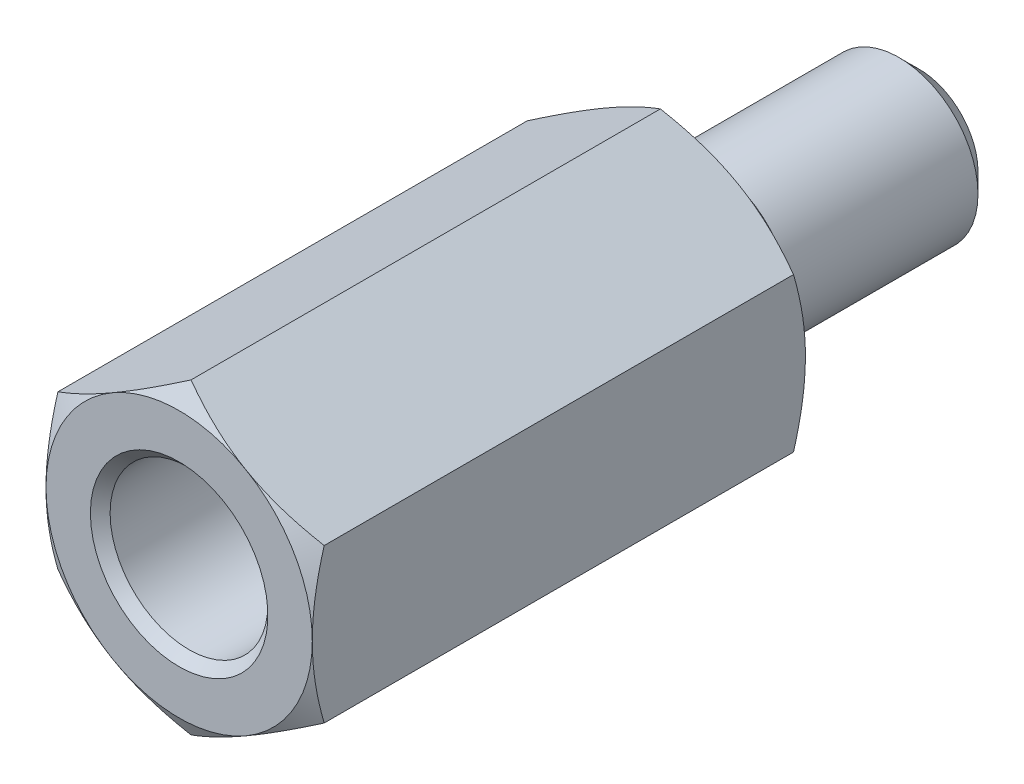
ISO-10303-21;
HEADER;
FILE_DESCRIPTION(('STEP AP214'),'2;1');
FILE_NAME('part.step','',(''),(''),'','','');
FILE_SCHEMA(('AUTOMOTIVE_DESIGN { 1 0 10303 214 1 1 1 1 }'));
ENDSEC;
DATA;
#1=APPLICATION_CONTEXT('core data for automotive mechanical design processes');
#2=APPLICATION_PROTOCOL_DEFINITION('international standard','automotive_design',2000,#1);
#3=PRODUCT_CONTEXT('',#1,'mechanical');
#4=PRODUCT('Part','Part','',(#3));
#5=PRODUCT_RELATED_PRODUCT_CATEGORY('part','',(#4));
#6=PRODUCT_DEFINITION_FORMATION('','',#4);
#7=PRODUCT_DEFINITION_CONTEXT('part definition',#1,'design');
#8=PRODUCT_DEFINITION('design','',#6,#7);
#9=PRODUCT_DEFINITION_SHAPE('','',#8);
#10=(LENGTH_UNIT() NAMED_UNIT(*) SI_UNIT(.MILLI.,.METRE.));
#11=(NAMED_UNIT(*) PLANE_ANGLE_UNIT() SI_UNIT($,.RADIAN.));
#12=(NAMED_UNIT(*) SI_UNIT($,.STERADIAN.) SOLID_ANGLE_UNIT());
#13=UNCERTAINTY_MEASURE_WITH_UNIT(LENGTH_MEASURE(1.E-05),#10,'distance_accuracy_value','');
#14=(GEOMETRIC_REPRESENTATION_CONTEXT(3) GLOBAL_UNCERTAINTY_ASSIGNED_CONTEXT((#13)) GLOBAL_UNIT_ASSIGNED_CONTEXT((#10,
#11,#12)) REPRESENTATION_CONTEXT('',''));
#15=CARTESIAN_POINT('',(0.,0.,0.));
#16=DIRECTION('',(0.,0.,1.));
#17=DIRECTION('',(1.,0.,0.));
#18=AXIS2_PLACEMENT_3D('',#15,#16,#17);
#19=CARTESIAN_POINT('',(0.,15.5884572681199,0.));
#20=DIRECTION('',(-0.5,-0.866025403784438,0.));
#21=DIRECTION('',(0.866025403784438,-0.5,0.));
#22=AXIS2_PLACEMENT_3D('',#19,#20,#21);
#23=PLANE('',#22);
#24=CARTESIAN_POINT('',(-0.000199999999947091,15.5885727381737,1.20583803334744));
#25=CARTESIAN_POINT('',(0.2965248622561,15.417258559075,1.10693600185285));
#26=CARTESIAN_POINT('',(0.594407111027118,15.2452761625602,1.0125219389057));
#27=CARTESIAN_POINT('',(1.19256027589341,14.899932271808,0.833917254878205));
#28=CARTESIAN_POINT('',(1.49283194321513,14.7265703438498,0.749729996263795));
#29=CARTESIAN_POINT('',(2.0963442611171,14.3781323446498,0.592710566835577));
#30=CARTESIAN_POINT('',(2.39959019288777,14.2030532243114,0.5199052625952));
#31=CARTESIAN_POINT('',(3.0081892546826,13.8516783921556,0.387213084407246));
#32=CARTESIAN_POINT('',(3.31354226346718,13.675382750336,0.327325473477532));
#33=CARTESIAN_POINT('',(3.91853115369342,13.3260922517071,0.223015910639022));
#34=CARTESIAN_POINT('',(4.2181221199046,13.1531233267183,0.17824871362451));
#35=CARTESIAN_POINT('',(4.81867684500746,12.8063928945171,0.103183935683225));
#36=CARTESIAN_POINT('',(5.11964063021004,12.632631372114,0.0728866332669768));
#37=CARTESIAN_POINT('',(5.72207378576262,12.284816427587,0.0275266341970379));
#38=CARTESIAN_POINT('',(6.02354212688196,12.1107635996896,0.0124458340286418));
#39=CARTESIAN_POINT('',(6.62675710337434,11.7624972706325,-0.00215683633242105));
#40=CARTESIAN_POINT('',(6.92850372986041,11.5882837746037,-0.00167918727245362));
#41=CARTESIAN_POINT('',(7.49261810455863,11.2625921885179,0.0137483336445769));
#42=CARTESIAN_POINT('',(7.75502605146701,11.1110908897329,0.0268164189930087));
#43=CARTESIAN_POINT('',(8.27923834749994,10.8084367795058,0.0644725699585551));
#44=CARTESIAN_POINT('',(8.54104265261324,10.6572839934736,0.0890614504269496));
#45=CARTESIAN_POINT('',(9.06390546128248,10.3554090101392,0.149330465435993));
#46=CARTESIAN_POINT('',(9.32496316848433,10.2046872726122,0.185019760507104));
#47=CARTESIAN_POINT('',(9.8458546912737,9.90395041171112,0.266863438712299));
#48=CARTESIAN_POINT('',(10.1056884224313,9.75393533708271,0.313018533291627));
#49=CARTESIAN_POINT('',(10.8944281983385,9.29855621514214,0.468349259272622));
#50=CARTESIAN_POINT('',(11.4210501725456,8.99451087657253,0.593013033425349));
#51=CARTESIAN_POINT('',(12.4664415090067,8.3909539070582,0.875948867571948));
#52=CARTESIAN_POINT('',(12.9852242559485,8.09143454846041,1.03415447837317));
#53=CARTESIAN_POINT('',(13.5002,7.79411316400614,1.20583803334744));
#54=B_SPLINE_CURVE_WITH_KNOTS('',3,(#24,#25,#26,#27,#28,#29,#30,#31,#32,#33,#34,#35,#36,#37,#38,
#39,#40,#41,#42,#43,#44,#45,#46,#47,#48,#49,#50,#51,#52,#53),.UNSPECIFIED.,.F.,.F.,(4,2,2,2,2,2,
2,2,2,2,2,2,2,2,4),(0.,1.06987949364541,2.14010980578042,3.21282939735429,4.28548777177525,
5.33167033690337,6.37787303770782,7.42282956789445,8.46775380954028,9.377387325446,
10.2870851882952,11.1975357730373,12.1080482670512,13.9691139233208,15.8265265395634),.UNSPECIFIED.);
#55=CARTESIAN_POINT('',(0.,15.5884572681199,1.20577136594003));
#56=VERTEX_POINT('',#55);
#57=CARTESIAN_POINT('',(6.75,11.6913429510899,0.));
#58=VERTEX_POINT('',#57);
#59=EDGE_CURVE('E233',#56,#58,#54,.T.);
#60=ORIENTED_EDGE('',*,*,#59,.F.);
#61=DIRECTION('',(0.,0.,1.));
#62=VECTOR('',#61,1.);
#63=CARTESIAN_POINT('',(0.,15.5884572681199,0.));
#64=LINE('',#63,#62);
#65=CARTESIAN_POINT('',(0.,15.5884572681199,48.79422863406));
#66=VERTEX_POINT('',#65);
#67=EDGE_CURVE('E275',#56,#66,#64,.T.);
#68=ORIENTED_EDGE('',*,*,#67,.T.);
#69=CARTESIAN_POINT('',(13.5002,7.79411316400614,48.7941619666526));
#70=CARTESIAN_POINT('',(13.2034751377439,7.96542734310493,48.8930639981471));
#71=CARTESIAN_POINT('',(12.9055928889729,8.13740973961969,48.9874780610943));
#72=CARTESIAN_POINT('',(12.3074397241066,8.48275363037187,49.1660827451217));
#73=CARTESIAN_POINT('',(12.0071680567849,8.65611555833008,49.2502700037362));
#74=CARTESIAN_POINT('',(11.4036557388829,9.00455355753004,49.4072894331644));
#75=CARTESIAN_POINT('',(11.1004098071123,9.1796326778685,49.4800947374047));
#76=CARTESIAN_POINT('',(10.4918107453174,9.5310075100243,49.6127869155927));
#77=CARTESIAN_POINT('',(10.1864577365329,9.70730315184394,49.6726745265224));
#78=CARTESIAN_POINT('',(9.58146884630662,10.0565936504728,49.7769840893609));
#79=CARTESIAN_POINT('',(9.28187788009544,10.2295625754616,49.8217512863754));
#80=CARTESIAN_POINT('',(8.68132315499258,10.5762930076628,49.8968160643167));
#81=CARTESIAN_POINT('',(8.38035936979,10.7500545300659,49.927113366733));
#82=CARTESIAN_POINT('',(7.77792621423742,11.0978694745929,49.9724733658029));
#83=CARTESIAN_POINT('',(7.47645787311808,11.2719223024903,49.9875541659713));
#84=CARTESIAN_POINT('',(6.87324289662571,11.6201886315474,50.0021568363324));
#85=CARTESIAN_POINT('',(6.57149627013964,11.7944021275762,50.0016791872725));
#86=CARTESIAN_POINT('',(6.00738189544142,12.1200937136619,49.9862516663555));
#87=CARTESIAN_POINT('',(5.74497394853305,12.271595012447,49.973183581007));
#88=CARTESIAN_POINT('',(5.22076165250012,12.5742491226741,49.9355274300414));
#89=CARTESIAN_POINT('',(4.95895734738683,12.7254019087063,49.910938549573));
#90=CARTESIAN_POINT('',(4.43609453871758,13.0272768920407,49.850669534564));
#91=CARTESIAN_POINT('',(4.17503683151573,13.1779986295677,49.8149802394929));
#92=CARTESIAN_POINT('',(3.65414530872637,13.4787354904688,49.7331365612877));
#93=CARTESIAN_POINT('',(3.39431157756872,13.6287505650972,49.6869814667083));
#94=CARTESIAN_POINT('',(2.60557180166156,14.0841296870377,49.5316507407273));
#95=CARTESIAN_POINT('',(2.0789498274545,14.3881750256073,49.4069869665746));
#96=CARTESIAN_POINT('',(1.03355849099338,14.9917319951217,49.124051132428));
#97=CARTESIAN_POINT('',(0.514775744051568,15.2912513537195,48.9658455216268));
#98=CARTESIAN_POINT('',(-0.000199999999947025,15.5885727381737,48.7941619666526));
#99=B_SPLINE_CURVE_WITH_KNOTS('',3,(#69,#70,#71,#72,#73,#74,#75,#76,#77,#78,#79,#80,#81,#82,#83,
#84,#85,#86,#87,#88,#89,#90,#91,#92,#93,#94,#95,#96,#97,#98),.UNSPECIFIED.,.F.,.F.,(4,2,2,2,2,2,
2,2,2,2,2,2,2,2,4),(0.,1.0698794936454,2.1401098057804,3.21282939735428,4.28548777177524,
5.33167033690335,6.37787303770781,7.42282956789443,8.46775380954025,9.37738732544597,
10.2870851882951,11.1975357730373,12.1080482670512,13.9691139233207,15.8265265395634),.UNSPECIFIED.);
#100=CARTESIAN_POINT('',(6.75,11.6913429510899,50.));
#101=VERTEX_POINT('',#100);
#102=EDGE_CURVE('E219',#101,#66,#99,.T.);
#103=ORIENTED_EDGE('',*,*,#102,.F.);
#104=CARTESIAN_POINT('',(13.5,7.79422863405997,48.79422863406));
#105=VERTEX_POINT('',#104);
#106=EDGE_CURVE('E225',#105,#101,#99,.T.);
#107=ORIENTED_EDGE('',*,*,#106,.F.);
#108=DIRECTION('',(0.,0.,1.));
#109=VECTOR('',#108,1.);
#110=CARTESIAN_POINT('',(13.5,7.79422863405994,0.));
#111=LINE('',#110,#109);
#112=CARTESIAN_POINT('',(13.5,7.79422863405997,1.20577136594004));
#113=VERTEX_POINT('',#112);
#114=EDGE_CURVE('E282',#113,#105,#111,.T.);
#115=ORIENTED_EDGE('',*,*,#114,.F.);
#116=EDGE_CURVE('E109',#58,#113,#54,.T.);
#117=ORIENTED_EDGE('',*,*,#116,.F.);
#118=EDGE_LOOP('',(#60,#68,#103,#107,#115,#117));
#119=FACE_BOUND('',#118,.T.);
#120=ADVANCED_FACE('F14',(#119),#23,.F.);
#121=CARTESIAN_POINT('',(13.5,7.79422863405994,0.));
#122=DIRECTION('',(-1.,0.,0.));
#123=DIRECTION('',(0.,-1.,0.));
#124=AXIS2_PLACEMENT_3D('',#121,#122,#123);
#125=PLANE('',#124);
#126=CARTESIAN_POINT('',(13.5,-21.0569386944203,6.64697015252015));
#127=CARTESIAN_POINT('',(13.5,-20.7616279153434,6.50344053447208));
#128=CARTESIAN_POINT('',(13.5,-20.4659738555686,6.36061754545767));
#129=CARTESIAN_POINT('',(13.5,-19.873907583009,6.07654462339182));
#130=CARTESIAN_POINT('',(13.5,-19.5774953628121,5.93529470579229));
#131=CARTESIAN_POINT('',(13.5,-18.6869368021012,5.51410780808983));
#132=CARTESIAN_POINT('',(13.5,-18.0915540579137,5.23677534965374));
#133=CARTESIAN_POINT('',(13.5,-16.8936617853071,4.68924251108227));
#134=CARTESIAN_POINT('',(13.5,-16.2911311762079,4.4190881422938));
#135=CARTESIAN_POINT('',(13.5,-15.0813205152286,3.88967008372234));
#136=CARTESIAN_POINT('',(13.5,-14.4740406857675,3.63040588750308));
#137=CARTESIAN_POINT('',(13.5,-13.2336742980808,3.11733514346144));
#138=CARTESIAN_POINT('',(13.5,-12.6003962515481,2.86398914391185));
#139=CARTESIAN_POINT('',(13.5,-11.3264714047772,2.37617968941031));
#140=CARTESIAN_POINT('',(13.5,-10.6858237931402,2.14171833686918));
#141=CARTESIAN_POINT('',(13.5,-9.39732192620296,1.69774880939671));
#142=CARTESIAN_POINT('',(13.5,-8.74948486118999,1.48819113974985));
#143=CARTESIAN_POINT('',(13.5,-7.44445715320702,1.10066123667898));
#144=CARTESIAN_POINT('',(13.5,-6.78726948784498,0.922679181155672));
#145=CARTESIAN_POINT('',(13.5,-5.7961823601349,0.686258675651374));
#146=CARTESIAN_POINT('',(13.5,-5.46586694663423,0.612707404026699));
#147=CARTESIAN_POINT('',(13.5,-4.80295689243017,0.476652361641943));
#148=CARTESIAN_POINT('',(13.5,-4.47036229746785,0.414148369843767));
#149=CARTESIAN_POINT('',(13.5,-3.80311436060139,0.301283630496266));
#150=CARTESIAN_POINT('',(13.5,-3.46846105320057,0.250922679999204));
#151=CARTESIAN_POINT('',(13.5,-2.79744039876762,0.163343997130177));
#152=CARTESIAN_POINT('',(13.5,-2.46107311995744,0.126125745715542));
#153=CARTESIAN_POINT('',(13.5,-1.7915386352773,0.0660452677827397));
#154=CARTESIAN_POINT('',(13.5,-1.45838799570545,0.0429995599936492));
#155=CARTESIAN_POINT('',(13.5,-0.79141089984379,0.011023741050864));
#156=CARTESIAN_POINT('',(13.5,-0.457584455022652,0.00209339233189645));
#157=CARTESIAN_POINT('',(13.5,0.210147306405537,-0.00143880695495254));
#158=CARTESIAN_POINT('',(13.5,0.544052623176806,0.00395937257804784));
#159=CARTESIAN_POINT('',(13.5,1.21133536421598,0.0289510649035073));
#160=CARTESIAN_POINT('',(13.5,1.54471276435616,0.048545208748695));
#161=CARTESIAN_POINT('',(13.5,2.34229936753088,0.111986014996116));
#162=CARTESIAN_POINT('',(13.5,2.80599824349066,0.162366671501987));
#163=CARTESIAN_POINT('',(13.5,3.73003641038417,0.287876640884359));
#164=CARTESIAN_POINT('',(13.5,4.19037524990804,0.363009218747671));
#165=CARTESIAN_POINT('',(13.5,5.10722680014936,0.535350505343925));
#166=CARTESIAN_POINT('',(13.5,5.5637363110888,0.632576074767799));
#167=CARTESIAN_POINT('',(13.5,6.4722162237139,0.846129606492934));
#168=CARTESIAN_POINT('',(13.5,6.92418668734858,0.962457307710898));
#169=CARTESIAN_POINT('',(13.5,7.83359451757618,1.21414501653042));
#170=CARTESIAN_POINT('',(13.5,8.29092996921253,1.3498707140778));
#171=CARTESIAN_POINT('',(13.5,9.20109742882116,1.63558762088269));
#172=CARTESIAN_POINT('',(13.5,9.65392940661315,1.78557892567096));
#173=CARTESIAN_POINT('',(13.5,10.5553094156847,2.09742440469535));
#174=CARTESIAN_POINT('',(13.5,11.0038587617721,2.25927479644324));
#175=CARTESIAN_POINT('',(13.5,11.8972246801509,2.59291064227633));
#176=CARTESIAN_POINT('',(13.5,12.3420412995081,2.7646959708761));
#177=CARTESIAN_POINT('',(13.5,13.4043189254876,3.1864116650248));
#178=CARTESIAN_POINT('',(13.5,14.0202104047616,3.4402899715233));
#179=CARTESIAN_POINT('',(13.5,15.2466286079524,3.96072764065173));
#180=CARTESIAN_POINT('',(13.5,15.8571549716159,4.22728784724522));
#181=CARTESIAN_POINT('',(13.5,17.0738609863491,4.77050993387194));
#182=CARTESIAN_POINT('',(13.5,17.6800395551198,5.04717423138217));
#183=CARTESIAN_POINT('',(13.5,18.8886406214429,5.60853210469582));
#184=CARTESIAN_POINT('',(13.5,19.4910632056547,5.89322549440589));
#185=CARTESIAN_POINT('',(13.5,20.6934797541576,6.46945014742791));
#186=CARTESIAN_POINT('',(13.5,21.2934701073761,6.76098893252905));
#187=CARTESIAN_POINT('',(13.5,22.4908283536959,7.3494022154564));
#188=CARTESIAN_POINT('',(13.5,23.0881962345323,7.64627673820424));
#189=CARTESIAN_POINT('',(13.5,24.2806356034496,8.24439256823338));
#190=CARTESIAN_POINT('',(13.5,24.8757073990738,8.54563326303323));
#191=CARTESIAN_POINT('',(13.5,26.0639732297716,9.15179768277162));
#192=CARTESIAN_POINT('',(13.5,26.6571672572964,9.45672142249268));
#193=CARTESIAN_POINT('',(13.5,28.3324548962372,10.3234062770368));
#194=CARTESIAN_POINT('',(13.5,29.4126790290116,10.8887809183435));
#195=CARTESIAN_POINT('',(13.5,31.5691126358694,12.0272157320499));
#196=CARTESIAN_POINT('',(13.5,32.6453219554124,12.6002761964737));
#197=CARTESIAN_POINT('',(13.5,34.7917877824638,13.7507617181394));
#198=CARTESIAN_POINT('',(13.5,35.8620524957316,14.3281714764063));
#199=CARTESIAN_POINT('',(13.5,37.4655621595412,15.1976891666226));
#200=CARTESIAN_POINT('',(13.5,37.9997356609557,15.4880872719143));
#201=CARTESIAN_POINT('',(13.5,39.0675256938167,16.0699037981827));
#202=CARTESIAN_POINT('',(13.5,39.6011422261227,16.3613222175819));
#203=CARTESIAN_POINT('',(13.5,40.1345120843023,16.6531915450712));
#204=B_SPLINE_CURVE_WITH_KNOTS('',3,(#126,#127,#128,#129,#130,#131,#132,#133,#134,#135,#136,
#137,#138,#139,#140,#141,#142,#143,#144,#145,#146,#147,#148,#149,#150,#151,#152,#153,#154,#155,
#156,#157,#158,#159,#160,#161,#162,#163,#164,#165,#166,#167,#168,#169,#170,#171,#172,#173,#174,
#175,#176,#177,#178,#179,#180,#181,#182,#183,#184,#185,#186,#187,#188,#189,#190,#191,#192,#193,
#194,#195,#196,#197,#198,#199,#200,#201,#202,#203),.UNSPECIFIED.,.F.,.F.,(4,2,2,2,2,2,2,2,2,2,2,
2,2,2,2,2,2,2,2,2,2,2,2,2,2,2,2,2,2,2,2,2,2,2,2,2,2,2,4),(0.,0.985027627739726,1.97006492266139,
3.94042482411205,5.92130991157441,7.90210277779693,9.94809552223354,11.9943157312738,
14.0363986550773,16.0778452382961,17.0929059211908,18.1079462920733,19.1229696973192,
20.1379530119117,21.139503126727,22.1410363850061,23.1425717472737,24.1441516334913,
25.5426637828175,26.9413604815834,28.3411282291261,29.7408768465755,31.1717507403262,
32.6026342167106,34.0330632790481,35.463474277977,37.4617762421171,39.4602113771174,
41.4591278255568,43.4579979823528,45.4591780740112,47.4603675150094,49.4612788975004,
51.4621983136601,55.1198546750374,58.7776504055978,62.4258974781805,64.2499173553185,
66.0739344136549),.UNSPECIFIED.);
#205=CARTESIAN_POINT('',(13.5,0.,0.));
#206=VERTEX_POINT('',#205);
#207=EDGE_CURVE('E102',#113,#206,#204,.F.);
#208=ORIENTED_EDGE('',*,*,#207,.F.);
#209=ORIENTED_EDGE('',*,*,#114,.T.);
#210=CARTESIAN_POINT('',(13.5,-21.0569386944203,43.3530298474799));
#211=CARTESIAN_POINT('',(13.5,-20.7616279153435,43.4965594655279));
#212=CARTESIAN_POINT('',(13.5,-20.4659738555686,43.6393824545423));
#213=CARTESIAN_POINT('',(13.5,-19.873907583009,43.9234553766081));
#214=CARTESIAN_POINT('',(13.5,-19.5774953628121,44.0647052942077));
#215=CARTESIAN_POINT('',(13.5,-18.6869368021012,44.4858921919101));
#216=CARTESIAN_POINT('',(13.5,-18.0915540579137,44.7632246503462));
#217=CARTESIAN_POINT('',(13.5,-16.8936617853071,45.3107574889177));
#218=CARTESIAN_POINT('',(13.5,-16.2911311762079,45.5809118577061));
#219=CARTESIAN_POINT('',(13.5,-15.0813205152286,46.1103299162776));
#220=CARTESIAN_POINT('',(13.5,-14.4740406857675,46.3695941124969));
#221=CARTESIAN_POINT('',(13.5,-13.2336742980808,46.8826648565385));
#222=CARTESIAN_POINT('',(13.5,-12.6003962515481,47.1360108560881));
#223=CARTESIAN_POINT('',(13.5,-11.3264714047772,47.6238203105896));
#224=CARTESIAN_POINT('',(13.5,-10.6858237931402,47.8582816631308));
#225=CARTESIAN_POINT('',(13.5,-9.39732192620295,48.3022511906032));
#226=CARTESIAN_POINT('',(13.5,-8.74948486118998,48.5118088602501));
#227=CARTESIAN_POINT('',(13.5,-7.44445715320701,48.899338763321));
#228=CARTESIAN_POINT('',(13.5,-6.78726948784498,49.0773208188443));
#229=CARTESIAN_POINT('',(13.5,-5.7961823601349,49.3137413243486));
#230=CARTESIAN_POINT('',(13.5,-5.46586694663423,49.3872925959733));
#231=CARTESIAN_POINT('',(13.5,-4.80295689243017,49.523347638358));
#232=CARTESIAN_POINT('',(13.5,-4.47036229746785,49.5858516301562));
#233=CARTESIAN_POINT('',(13.5,-3.80311436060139,49.6987163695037));
#234=CARTESIAN_POINT('',(13.5,-3.46846105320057,49.7490773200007));
#235=CARTESIAN_POINT('',(13.5,-2.79744039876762,49.8366560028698));
#236=CARTESIAN_POINT('',(13.5,-2.46107311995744,49.8738742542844));
#237=CARTESIAN_POINT('',(13.5,-1.7915386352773,49.9339547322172));
#238=CARTESIAN_POINT('',(13.5,-1.45838799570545,49.9570004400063));
#239=CARTESIAN_POINT('',(13.5,-0.791410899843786,49.9889762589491));
#240=CARTESIAN_POINT('',(13.5,-0.457584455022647,49.9979066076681));
#241=CARTESIAN_POINT('',(13.5,0.210147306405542,50.0014388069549));
#242=CARTESIAN_POINT('',(13.5,0.544052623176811,49.9960406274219));
#243=CARTESIAN_POINT('',(13.5,1.21133536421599,49.9710489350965));
#244=CARTESIAN_POINT('',(13.5,1.54471276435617,49.9514547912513));
#245=CARTESIAN_POINT('',(13.5,2.34229936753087,49.8880139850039));
#246=CARTESIAN_POINT('',(13.5,2.80599824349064,49.837633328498));
#247=CARTESIAN_POINT('',(13.5,3.73003641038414,49.7121233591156));
#248=CARTESIAN_POINT('',(13.5,4.19037524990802,49.6369907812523));
#249=CARTESIAN_POINT('',(13.5,5.10722680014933,49.464649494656));
#250=CARTESIAN_POINT('',(13.5,5.56373631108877,49.3674239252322));
#251=CARTESIAN_POINT('',(13.5,6.47221622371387,49.153870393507));
#252=CARTESIAN_POINT('',(13.5,6.92418668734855,49.0375426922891));
#253=CARTESIAN_POINT('',(13.5,7.83359451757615,48.7858549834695));
#254=CARTESIAN_POINT('',(13.5,8.2909299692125,48.6501292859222));
#255=CARTESIAN_POINT('',(13.5,9.20109742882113,48.3644123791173));
#256=CARTESIAN_POINT('',(13.5,9.65392940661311,48.214421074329));
#257=CARTESIAN_POINT('',(13.5,10.5553094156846,47.9025755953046));
#258=CARTESIAN_POINT('',(13.5,11.003858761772,47.7407252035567));
#259=CARTESIAN_POINT('',(13.5,11.8972246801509,47.4070893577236));
#260=CARTESIAN_POINT('',(13.5,12.3420412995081,47.2353040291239));
#261=CARTESIAN_POINT('',(13.5,13.4043189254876,46.8135883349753));
#262=CARTESIAN_POINT('',(13.5,14.0202104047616,46.5597100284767));
#263=CARTESIAN_POINT('',(13.5,15.2466286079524,46.0392723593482));
#264=CARTESIAN_POINT('',(13.5,15.8571549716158,45.7727121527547));
#265=CARTESIAN_POINT('',(13.5,17.0738609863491,45.229490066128));
#266=CARTESIAN_POINT('',(13.5,17.6800395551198,44.9528257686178));
#267=CARTESIAN_POINT('',(13.5,18.8886406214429,44.3914678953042));
#268=CARTESIAN_POINT('',(13.5,19.4910632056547,44.1067745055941));
#269=CARTESIAN_POINT('',(13.5,20.6934797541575,43.5305498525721));
#270=CARTESIAN_POINT('',(13.5,21.2934701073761,43.2390110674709));
#271=CARTESIAN_POINT('',(13.5,22.4908283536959,42.6505977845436));
#272=CARTESIAN_POINT('',(13.5,23.0881962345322,42.3537232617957));
#273=CARTESIAN_POINT('',(13.5,24.2806356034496,41.7556074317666));
#274=CARTESIAN_POINT('',(13.5,24.8757073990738,41.4543667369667));
#275=CARTESIAN_POINT('',(13.5,26.0639732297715,40.8482023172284));
#276=CARTESIAN_POINT('',(13.5,26.6571672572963,40.5432785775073));
#277=CARTESIAN_POINT('',(13.5,28.3324548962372,39.6765937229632));
#278=CARTESIAN_POINT('',(13.5,29.4126790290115,39.1112190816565));
#279=CARTESIAN_POINT('',(13.5,31.5691126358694,37.97278426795));
#280=CARTESIAN_POINT('',(13.5,32.6453219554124,37.3997238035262));
#281=CARTESIAN_POINT('',(13.5,34.7917877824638,36.2492382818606));
#282=CARTESIAN_POINT('',(13.5,35.8620524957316,35.6718285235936));
#283=CARTESIAN_POINT('',(13.5,37.4655621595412,34.8023108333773));
#284=CARTESIAN_POINT('',(13.5,37.9997356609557,34.5119127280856));
#285=CARTESIAN_POINT('',(13.5,39.0675256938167,33.9300962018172));
#286=CARTESIAN_POINT('',(13.5,39.6011422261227,33.638677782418));
#287=CARTESIAN_POINT('',(13.5,40.1345120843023,33.3468084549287));
#288=B_SPLINE_CURVE_WITH_KNOTS('',3,(#210,#211,#212,#213,#214,#215,#216,#217,#218,#219,#220,
#221,#222,#223,#224,#225,#226,#227,#228,#229,#230,#231,#232,#233,#234,#235,#236,#237,#238,#239,
#240,#241,#242,#243,#244,#245,#246,#247,#248,#249,#250,#251,#252,#253,#254,#255,#256,#257,#258,
#259,#260,#261,#262,#263,#264,#265,#266,#267,#268,#269,#270,#271,#272,#273,#274,#275,#276,#277,
#278,#279,#280,#281,#282,#283,#284,#285,#286,#287),.UNSPECIFIED.,.F.,.F.,(4,2,2,2,2,2,2,2,2,2,2,
2,2,2,2,2,2,2,2,2,2,2,2,2,2,2,2,2,2,2,2,2,2,2,2,2,2,2,4),(0.,0.985027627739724,1.97006492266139,
3.94042482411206,5.92130991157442,7.90210277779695,9.94809552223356,11.9943157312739,
14.0363986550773,16.0778452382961,17.0929059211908,18.1079462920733,19.1229696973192,
20.1379530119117,21.139503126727,22.1410363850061,23.1425717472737,24.1441516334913,
25.5426637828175,26.9413604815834,28.3411282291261,29.7408768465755,31.1717507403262,
32.6026342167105,34.0330632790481,35.4634742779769,37.4617762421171,39.4602113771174,
41.4591278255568,43.4579979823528,45.4591780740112,47.4603675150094,49.4612788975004,
51.46219831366,55.1198546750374,58.7776504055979,62.4258974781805,64.2499173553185,
66.073934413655),.UNSPECIFIED.);
#289=CARTESIAN_POINT('',(13.5,0.,50.));
#290=VERTEX_POINT('',#289);
#291=EDGE_CURVE('E167',#290,#105,#288,.T.);
#292=ORIENTED_EDGE('',*,*,#291,.F.);
#293=CARTESIAN_POINT('',(13.5,-7.79422863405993,48.79422863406));
#294=VERTEX_POINT('',#293);
#295=EDGE_CURVE('E175',#294,#290,#288,.T.);
#296=ORIENTED_EDGE('',*,*,#295,.F.);
#297=DIRECTION('',(0.,0.,1.));
#298=VECTOR('',#297,1.);
#299=CARTESIAN_POINT('',(13.5,-7.79422863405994,0.));
#300=LINE('',#299,#298);
#301=CARTESIAN_POINT('',(13.5,-7.79422863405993,1.20577136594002));
#302=VERTEX_POINT('',#301);
#303=EDGE_CURVE('E137',#302,#294,#300,.T.);
#304=ORIENTED_EDGE('',*,*,#303,.F.);
#305=EDGE_CURVE('E114',#206,#302,#204,.F.);
#306=ORIENTED_EDGE('',*,*,#305,.F.);
#307=EDGE_LOOP('',(#208,#209,#292,#296,#304,#306));
#308=FACE_BOUND('',#307,.T.);
#309=ADVANCED_FACE('F135',(#308),#125,.F.);
#310=CARTESIAN_POINT('',(0.,-15.5884572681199,0.));
#311=DIRECTION('',(0.5,-0.866025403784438,0.));
#312=DIRECTION('',(0.866025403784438,0.5,0.));
#313=AXIS2_PLACEMENT_3D('',#310,#311,#312);
#314=PLANE('',#313);
#315=DIRECTION('',(0.,0.,1.));
#316=VECTOR('',#315,1.);
#317=CARTESIAN_POINT('',(0.,-15.5884572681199,0.));
#318=LINE('',#317,#316);
#319=CARTESIAN_POINT('',(0.,-15.5884572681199,1.20577136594));
#320=VERTEX_POINT('',#319);
#321=CARTESIAN_POINT('',(0.,-15.5884572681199,48.79422863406));
#322=VERTEX_POINT('',#321);
#323=EDGE_CURVE('E277',#320,#322,#318,.T.);
#324=ORIENTED_EDGE('',*,*,#323,.F.);
#325=CARTESIAN_POINT('',(-0.000199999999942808,-15.5885727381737,1.20583803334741));
#326=CARTESIAN_POINT('',(0.296524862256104,-15.4172585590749,1.10693600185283));
#327=CARTESIAN_POINT('',(0.59440711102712,-15.2452761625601,1.01252193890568));
#328=CARTESIAN_POINT('',(1.19256027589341,-14.899932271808,0.833917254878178));
#329=CARTESIAN_POINT('',(1.49283194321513,-14.7265703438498,0.749729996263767));
#330=CARTESIAN_POINT('',(2.09634426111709,-14.3781323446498,0.59271056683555));
#331=CARTESIAN_POINT('',(2.39959019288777,-14.2030532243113,0.519905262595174));
#332=CARTESIAN_POINT('',(3.0081892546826,-13.8516783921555,0.387213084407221));
#333=CARTESIAN_POINT('',(3.31354226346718,-13.6753827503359,0.327325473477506));
#334=CARTESIAN_POINT('',(3.91853115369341,-13.3260922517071,0.223015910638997));
#335=CARTESIAN_POINT('',(4.21812211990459,-13.1531233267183,0.178248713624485));
#336=CARTESIAN_POINT('',(4.81867684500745,-12.806392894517,0.103183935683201));
#337=CARTESIAN_POINT('',(5.11964063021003,-12.632631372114,0.0728866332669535));
#338=CARTESIAN_POINT('',(5.7220737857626,-12.2848164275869,0.0275266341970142));
#339=CARTESIAN_POINT('',(6.02354212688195,-12.1107635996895,0.0124458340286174));
#340=CARTESIAN_POINT('',(6.62675710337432,-11.7624972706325,-0.00215683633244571));
#341=CARTESIAN_POINT('',(6.92850372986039,-11.5882837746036,-0.00167918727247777));
#342=CARTESIAN_POINT('',(7.49261810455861,-11.2625921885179,0.0137483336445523));
#343=CARTESIAN_POINT('',(7.75502605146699,-11.1110908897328,0.0268164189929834));
#344=CARTESIAN_POINT('',(8.27923834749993,-10.8084367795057,0.0644725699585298));
#345=CARTESIAN_POINT('',(8.54104265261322,-10.6572839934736,0.0890614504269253));
#346=CARTESIAN_POINT('',(9.06390546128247,-10.3554090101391,0.14933046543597));
#347=CARTESIAN_POINT('',(9.32496316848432,-10.2046872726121,0.185019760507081));
#348=CARTESIAN_POINT('',(9.84585469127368,-9.90395041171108,0.266863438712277));
#349=CARTESIAN_POINT('',(10.1056884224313,-9.75393533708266,0.313018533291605));
#350=CARTESIAN_POINT('',(10.8944281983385,-9.2985562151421,0.468349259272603));
#351=CARTESIAN_POINT('',(11.4210501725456,-8.99451087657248,0.593013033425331));
#352=CARTESIAN_POINT('',(12.4664415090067,-8.39095390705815,0.875948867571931));
#353=CARTESIAN_POINT('',(12.9852242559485,-8.09143454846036,1.03415447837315));
#354=CARTESIAN_POINT('',(13.5002,-7.79411316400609,1.20583803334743));
#355=B_SPLINE_CURVE_WITH_KNOTS('',3,(#325,#326,#327,#328,#329,#330,#331,#332,#333,#334,#335,
#336,#337,#338,#339,#340,#341,#342,#343,#344,#345,#346,#347,#348,#349,#350,#351,#352,#353,#354),
.UNSPECIFIED.,.F.,.F.,(4,2,2,2,2,2,2,2,2,2,2,2,2,2,4),(0.,1.0698794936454,2.14010980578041,
3.21282939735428,4.28548777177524,5.33167033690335,6.3778730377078,7.42282956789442,
8.46775380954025,9.37738732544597,10.2870851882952,11.1975357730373,12.1080482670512,
13.9691139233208,15.8265265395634),.UNSPECIFIED.);
#356=CARTESIAN_POINT('',(6.75,-11.6913429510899,0.));
#357=VERTEX_POINT('',#356);
#358=EDGE_CURVE('E139',#320,#357,#355,.T.);
#359=ORIENTED_EDGE('',*,*,#358,.T.);
#360=EDGE_CURVE('E121',#357,#302,#355,.T.);
#361=ORIENTED_EDGE('',*,*,#360,.T.);
#362=ORIENTED_EDGE('',*,*,#303,.T.);
#363=CARTESIAN_POINT('',(13.5002,-7.79411316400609,48.7941619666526));
#364=CARTESIAN_POINT('',(13.2034751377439,-7.96542734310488,48.8930639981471));
#365=CARTESIAN_POINT('',(12.9055928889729,-8.13740973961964,48.9874780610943));
#366=CARTESIAN_POINT('',(12.3074397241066,-8.48275363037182,49.1660827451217));
#367=CARTESIAN_POINT('',(12.0071680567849,-8.65611555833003,49.2502700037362));
#368=CARTESIAN_POINT('',(11.4036557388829,-9.00455355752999,49.4072894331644));
#369=CARTESIAN_POINT('',(11.1004098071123,-9.17963267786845,49.4800947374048));
#370=CARTESIAN_POINT('',(10.4918107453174,-9.53100751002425,49.6127869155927));
#371=CARTESIAN_POINT('',(10.1864577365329,-9.70730315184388,49.6726745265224));
#372=CARTESIAN_POINT('',(9.58146884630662,-10.0565936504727,49.7769840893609));
#373=CARTESIAN_POINT('',(9.28187788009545,-10.2295625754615,49.8217512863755));
#374=CARTESIAN_POINT('',(8.68132315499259,-10.5762930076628,49.8968160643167));
#375=CARTESIAN_POINT('',(8.38035936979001,-10.7500545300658,49.927113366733));
#376=CARTESIAN_POINT('',(7.77792621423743,-11.0978694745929,49.9724733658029));
#377=CARTESIAN_POINT('',(7.47645787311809,-11.2719223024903,49.9875541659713));
#378=CARTESIAN_POINT('',(6.87324289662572,-11.6201886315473,50.0021568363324));
#379=CARTESIAN_POINT('',(6.57149627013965,-11.7944021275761,50.0016791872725));
#380=CARTESIAN_POINT('',(6.00738189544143,-12.1200937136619,49.9862516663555));
#381=CARTESIAN_POINT('',(5.74497394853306,-12.2715950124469,49.973183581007));
#382=CARTESIAN_POINT('',(5.22076165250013,-12.5742491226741,49.9355274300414));
#383=CARTESIAN_POINT('',(4.95895734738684,-12.7254019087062,49.910938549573));
#384=CARTESIAN_POINT('',(4.43609453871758,-13.0272768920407,49.850669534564));
#385=CARTESIAN_POINT('',(4.17503683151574,-13.1779986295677,49.8149802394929));
#386=CARTESIAN_POINT('',(3.65414530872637,-13.4787354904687,49.7331365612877));
#387=CARTESIAN_POINT('',(3.39431157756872,-13.6287505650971,49.6869814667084));
#388=CARTESIAN_POINT('',(2.60557180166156,-14.0841296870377,49.5316507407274));
#389=CARTESIAN_POINT('',(2.07894982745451,-14.3881750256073,49.4069869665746));
#390=CARTESIAN_POINT('',(1.03355849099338,-14.9917319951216,49.124051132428));
#391=CARTESIAN_POINT('',(0.514775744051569,-15.2912513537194,48.9658455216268));
#392=CARTESIAN_POINT('',(-0.00019999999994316,-15.5885727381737,48.7941619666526));
#393=B_SPLINE_CURVE_WITH_KNOTS('',3,(#363,#364,#365,#366,#367,#368,#369,#370,#371,#372,#373,
#374,#375,#376,#377,#378,#379,#380,#381,#382,#383,#384,#385,#386,#387,#388,#389,#390,#391,#392),
.UNSPECIFIED.,.F.,.F.,(4,2,2,2,2,2,2,2,2,2,2,2,2,2,4),(0.,1.0698794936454,2.1401098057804,
3.21282939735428,4.28548777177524,5.33167033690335,6.3778730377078,7.42282956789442,
8.46775380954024,9.37738732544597,10.2870851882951,11.1975357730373,12.1080482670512,
13.9691139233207,15.8265265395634),.UNSPECIFIED.);
#394=CARTESIAN_POINT('',(6.75,-11.6913429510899,50.));
#395=VERTEX_POINT('',#394);
#396=EDGE_CURVE('E176',#294,#395,#393,.T.);
#397=ORIENTED_EDGE('',*,*,#396,.T.);
#398=EDGE_CURVE('E177',#395,#322,#393,.T.);
#399=ORIENTED_EDGE('',*,*,#398,.T.);
#400=EDGE_LOOP('',(#324,#359,#361,#362,#397,#399));
#401=FACE_BOUND('',#400,.T.);
#402=ADVANCED_FACE('F160',(#401),#314,.T.);
#403=CARTESIAN_POINT('',(0.,-15.5884572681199,0.));
#404=DIRECTION('',(0.5,0.866025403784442,0.));
#405=DIRECTION('',(-0.866025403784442,0.5,0.));
#406=AXIS2_PLACEMENT_3D('',#403,#404,#405);
#407=PLANE('',#406);
#408=CARTESIAN_POINT('',(0.000200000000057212,-15.5885727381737,1.20583803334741));
#409=CARTESIAN_POINT('',(-0.296524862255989,-15.4172585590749,1.10693600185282));
#410=CARTESIAN_POINT('',(-0.594407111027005,-15.2452761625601,1.01252193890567));
#411=CARTESIAN_POINT('',(-1.19256027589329,-14.899932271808,0.833917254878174));
#412=CARTESIAN_POINT('',(-1.49283194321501,-14.7265703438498,0.749729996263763));
#413=CARTESIAN_POINT('',(-2.09634426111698,-14.3781323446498,0.592710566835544));
#414=CARTESIAN_POINT('',(-2.39959019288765,-14.2030532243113,0.519905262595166));
#415=CARTESIAN_POINT('',(-3.00818925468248,-13.8516783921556,0.387213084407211));
#416=CARTESIAN_POINT('',(-3.31354226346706,-13.6753827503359,0.327325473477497));
#417=CARTESIAN_POINT('',(-3.9185311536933,-13.3260922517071,0.223015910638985));
#418=CARTESIAN_POINT('',(-4.21812211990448,-13.1531233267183,0.178248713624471));
#419=CARTESIAN_POINT('',(-4.81867684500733,-12.806392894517,0.103183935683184));
#420=CARTESIAN_POINT('',(-5.11964063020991,-12.632631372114,0.0728866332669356));
#421=CARTESIAN_POINT('',(-5.72207378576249,-12.284816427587,0.0275266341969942));
#422=CARTESIAN_POINT('',(-6.02354212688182,-12.1107635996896,0.0124458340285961));
#423=CARTESIAN_POINT('',(-6.6267571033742,-11.7624972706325,-0.00215683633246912));
#424=CARTESIAN_POINT('',(-6.92850372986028,-11.5882837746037,-0.00167918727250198));
#425=CARTESIAN_POINT('',(-7.4926181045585,-11.2625921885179,0.0137483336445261));
#426=CARTESIAN_POINT('',(-7.75502605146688,-11.1110908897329,0.0268164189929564));
#427=CARTESIAN_POINT('',(-8.27923834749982,-10.8084367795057,0.0644725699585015));
#428=CARTESIAN_POINT('',(-8.54104265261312,-10.6572839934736,0.0890614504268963));
#429=CARTESIAN_POINT('',(-9.06390546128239,-10.3554090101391,0.149330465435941));
#430=CARTESIAN_POINT('',(-9.32496316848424,-10.2046872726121,0.185019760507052));
#431=CARTESIAN_POINT('',(-9.84585469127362,-9.90395041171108,0.266863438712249));
#432=CARTESIAN_POINT('',(-10.1056884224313,-9.75393533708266,0.313018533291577));
#433=CARTESIAN_POINT('',(-10.8944281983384,-9.29855621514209,0.468349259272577));
#434=CARTESIAN_POINT('',(-11.4210501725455,-8.99451087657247,0.593013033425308));
#435=CARTESIAN_POINT('',(-12.4664415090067,-8.39095390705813,0.875948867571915));
#436=CARTESIAN_POINT('',(-12.9852242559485,-8.09143454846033,1.03415447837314));
#437=CARTESIAN_POINT('',(-13.5002,-7.79411316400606,1.20583803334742));
#438=B_SPLINE_CURVE_WITH_KNOTS('',3,(#408,#409,#410,#411,#412,#413,#414,#415,#416,#417,#418,
#419,#420,#421,#422,#423,#424,#425,#426,#427,#428,#429,#430,#431,#432,#433,#434,#435,#436,#437),
.UNSPECIFIED.,.F.,.F.,(4,2,2,2,2,2,2,2,2,2,2,2,2,2,4),(0.,1.0698794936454,2.14010980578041,
3.21282939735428,4.28548777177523,5.33167033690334,6.37787303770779,7.42282956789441,
8.46775380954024,9.37738732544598,10.2870851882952,11.1975357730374,12.1080482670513,
13.9691139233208,15.8265265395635),.UNSPECIFIED.);
#439=CARTESIAN_POINT('',(-6.75,-11.6913429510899,0.));
#440=VERTEX_POINT('',#439);
#441=EDGE_CURVE('E250',#320,#440,#438,.T.);
#442=ORIENTED_EDGE('',*,*,#441,.F.);
#443=ORIENTED_EDGE('',*,*,#323,.T.);
#444=CARTESIAN_POINT('',(-13.5002,-7.79411316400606,48.7941619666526));
#445=CARTESIAN_POINT('',(-13.2034751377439,-7.96542734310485,48.8930639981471));
#446=CARTESIAN_POINT('',(-12.9055928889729,-8.13740973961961,48.9874780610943));
#447=CARTESIAN_POINT('',(-12.3074397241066,-8.48275363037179,49.1660827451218));
#448=CARTESIAN_POINT('',(-12.0071680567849,-8.65611555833,49.2502700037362));
#449=CARTESIAN_POINT('',(-11.403655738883,-9.00455355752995,49.4072894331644));
#450=CARTESIAN_POINT('',(-11.1004098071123,-9.17963267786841,49.4800947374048));
#451=CARTESIAN_POINT('',(-10.4918107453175,-9.5310075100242,49.6127869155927));
#452=CARTESIAN_POINT('',(-10.1864577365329,-9.70730315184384,49.6726745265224));
#453=CARTESIAN_POINT('',(-9.58146884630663,-10.0565936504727,49.776984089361));
#454=CARTESIAN_POINT('',(-9.28187788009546,-10.2295625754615,49.8217512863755));
#455=CARTESIAN_POINT('',(-8.6813231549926,-10.5762930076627,49.8968160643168));
#456=CARTESIAN_POINT('',(-8.38035936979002,-10.7500545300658,49.927113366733));
#457=CARTESIAN_POINT('',(-7.77792621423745,-11.0978694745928,49.9724733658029));
#458=CARTESIAN_POINT('',(-7.47645787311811,-11.2719223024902,49.9875541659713));
#459=CARTESIAN_POINT('',(-6.87324289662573,-11.6201886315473,50.0021568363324));
#460=CARTESIAN_POINT('',(-6.57149627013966,-11.7944021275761,50.0016791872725));
#461=CARTESIAN_POINT('',(-6.00738189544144,-12.1200937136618,49.9862516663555));
#462=CARTESIAN_POINT('',(-5.74497394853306,-12.2715950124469,49.973183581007));
#463=CARTESIAN_POINT('',(-5.22076165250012,-12.574249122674,49.9355274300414));
#464=CARTESIAN_POINT('',(-4.95895734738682,-12.7254019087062,49.9109385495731));
#465=CARTESIAN_POINT('',(-4.43609453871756,-13.0272768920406,49.850669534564));
#466=CARTESIAN_POINT('',(-4.1750368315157,-13.1779986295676,49.8149802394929));
#467=CARTESIAN_POINT('',(-3.65414530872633,-13.4787354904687,49.7331365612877));
#468=CARTESIAN_POINT('',(-3.39431157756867,-13.6287505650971,49.6869814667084));
#469=CARTESIAN_POINT('',(-2.6055718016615,-14.0841296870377,49.5316507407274));
#470=CARTESIAN_POINT('',(-2.07894982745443,-14.3881750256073,49.4069869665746));
#471=CARTESIAN_POINT('',(-1.03355849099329,-14.9917319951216,49.1240511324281));
#472=CARTESIAN_POINT('',(-0.514775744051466,-15.2912513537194,48.9658455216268));
#473=CARTESIAN_POINT('',(0.000200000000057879,-15.5885727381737,48.7941619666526));
#474=B_SPLINE_CURVE_WITH_KNOTS('',3,(#444,#445,#446,#447,#448,#449,#450,#451,#452,#453,#454,
#455,#456,#457,#458,#459,#460,#461,#462,#463,#464,#465,#466,#467,#468,#469,#470,#471,#472,#473),
.UNSPECIFIED.,.F.,.F.,(4,2,2,2,2,2,2,2,2,2,2,2,2,2,4),(0.,1.0698794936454,2.1401098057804,
3.21282939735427,4.28548777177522,5.33167033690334,6.37787303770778,7.4228295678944,
8.46775380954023,9.37738732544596,10.2870851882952,11.1975357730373,12.1080482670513,
13.9691139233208,15.8265265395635),.UNSPECIFIED.);
#475=CARTESIAN_POINT('',(-6.75,-11.6913429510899,50.));
#476=VERTEX_POINT('',#475);
#477=EDGE_CURVE('E354',#476,#322,#474,.T.);
#478=ORIENTED_EDGE('',*,*,#477,.F.);
#479=CARTESIAN_POINT('',(-13.5,-7.79422863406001,48.79422863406));
#480=VERTEX_POINT('',#479);
#481=EDGE_CURVE('E214',#480,#476,#474,.T.);
#482=ORIENTED_EDGE('',*,*,#481,.F.);
#483=DIRECTION('',(0.,0.,1.));
#484=VECTOR('',#483,1.);
#485=CARTESIAN_POINT('',(-13.5,-7.79422863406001,0.));
#486=LINE('',#485,#484);
#487=CARTESIAN_POINT('',(-13.5,-7.79422863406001,1.20577136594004));
#488=VERTEX_POINT('',#487);
#489=EDGE_CURVE('E274',#488,#480,#486,.T.);
#490=ORIENTED_EDGE('',*,*,#489,.F.);
#491=EDGE_CURVE('E245',#440,#488,#438,.T.);
#492=ORIENTED_EDGE('',*,*,#491,.F.);
#493=EDGE_LOOP('',(#442,#443,#478,#482,#490,#492));
#494=FACE_BOUND('',#493,.T.);
#495=ADVANCED_FACE('F251',(#494),#407,.F.);
#496=CARTESIAN_POINT('',(-13.5,7.79422863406,0.));
#497=DIRECTION('',(-1.,0.,0.));
#498=DIRECTION('',(0.,-1.,0.));
#499=AXIS2_PLACEMENT_3D('',#496,#497,#498);
#500=PLANE('',#499);
#501=DIRECTION('',(0.,0.,1.));
#502=VECTOR('',#501,1.);
#503=CARTESIAN_POINT('',(-13.5,7.79422863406,0.));
#504=LINE('',#503,#502);
#505=CARTESIAN_POINT('',(-13.5,7.79422863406,1.20577136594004));
#506=VERTEX_POINT('',#505);
#507=CARTESIAN_POINT('',(-13.5,7.79422863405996,48.79422863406));
#508=VERTEX_POINT('',#507);
#509=EDGE_CURVE('E269',#506,#508,#504,.T.);
#510=ORIENTED_EDGE('',*,*,#509,.F.);
#511=CARTESIAN_POINT('',(-13.5,-21.0569386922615,6.64697015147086));
#512=CARTESIAN_POINT('',(-13.5,-20.7616279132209,6.50344053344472));
#513=CARTESIAN_POINT('',(-13.5,-20.4659738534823,6.36061754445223));
#514=CARTESIAN_POINT('',(-13.5,-19.8739075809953,6.07654462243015));
#515=CARTESIAN_POINT('',(-13.5,-19.5774953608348,5.93529470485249));
#516=CARTESIAN_POINT('',(-13.5,-18.686936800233,5.51410780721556));
#517=CARTESIAN_POINT('',(-13.5,-18.0915540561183,5.23677534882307));
#518=CARTESIAN_POINT('',(-13.5,-16.8936617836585,4.68924251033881));
#519=CARTESIAN_POINT('',(-13.5,-16.2911311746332,4.41908814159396));
#520=CARTESIAN_POINT('',(-13.5,-15.0813205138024,3.889670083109));
#521=CARTESIAN_POINT('',(-13.5,-14.4740406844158,3.63040588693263));
#522=CARTESIAN_POINT('',(-13.5,-13.2336742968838,3.11733514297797));
#523=CARTESIAN_POINT('',(-13.5,-12.6003962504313,2.86398914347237));
#524=CARTESIAN_POINT('',(-13.5,-11.3264714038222,2.37617968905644));
#525=CARTESIAN_POINT('',(-13.5,-10.6858237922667,2.14171833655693));
#526=CARTESIAN_POINT('',(-13.5,-9.39732192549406,1.6977488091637));
#527=CARTESIAN_POINT('',(-13.5,-8.74948486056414,1.48819113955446));
#528=CARTESIAN_POINT('',(-13.5,-7.44445715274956,1.10066123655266));
#529=CARTESIAN_POINT('',(-13.5,-6.78726948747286,0.922679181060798));
#530=CARTESIAN_POINT('',(-13.5,-5.79618235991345,0.686258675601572));
#531=CARTESIAN_POINT('',(-13.5,-5.46586694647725,0.612707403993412));
#532=CARTESIAN_POINT('',(-13.5,-4.80295689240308,0.476652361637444));
#533=CARTESIAN_POINT('',(-13.5,-4.47036229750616,0.414148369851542));
#534=CARTESIAN_POINT('',(-13.5,-3.80311436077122,0.30128363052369));
#535=CARTESIAN_POINT('',(-13.5,-3.46846105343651,0.250922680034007));
#536=CARTESIAN_POINT('',(-13.5,-2.79744039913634,0.163343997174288));
#537=CARTESIAN_POINT('',(-13.5,-2.46107312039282,0.126125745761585));
#538=CARTESIAN_POINT('',(-13.5,-1.79153863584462,0.0660452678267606));
#539=CARTESIAN_POINT('',(-13.5,-1.45838799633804,0.0429995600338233));
#540=CARTESIAN_POINT('',(-13.5,-0.791410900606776,0.0110237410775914));
#541=CARTESIAN_POINT('',(-13.5,-0.457584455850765,0.00209339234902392));
#542=CARTESIAN_POINT('',(-13.5,0.210147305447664,-0.00143880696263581));
#543=CARTESIAN_POINT('',(-13.5,0.5440526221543,0.00395937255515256));
#544=CARTESIAN_POINT('',(-13.5,1.21133536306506,0.0289510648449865));
#545=CARTESIAN_POINT('',(-13.5,1.54471276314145,0.0485452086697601));
#546=CARTESIAN_POINT('',(-13.5,2.34229936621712,0.111986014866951));
#547=CARTESIAN_POINT('',(-13.5,2.80599824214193,0.162366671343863));
#548=CARTESIAN_POINT('',(-13.5,3.73003640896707,0.287876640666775));
#549=CARTESIAN_POINT('',(-13.5,4.19037524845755,0.363009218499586));
#550=CARTESIAN_POINT('',(-13.5,5.10722679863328,0.535350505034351));
#551=CARTESIAN_POINT('',(-13.5,5.56373630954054,0.632576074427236));
#552=CARTESIAN_POINT('',(-13.5,6.47221622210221,0.846129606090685));
#553=CARTESIAN_POINT('',(-13.5,6.92418668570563,0.962457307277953));
#554=CARTESIAN_POINT('',(-13.5,7.83359451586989,1.21414501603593));
#555=CARTESIAN_POINT('',(-13.5,8.29092996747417,1.34987071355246));
#556=CARTESIAN_POINT('',(-13.5,9.201097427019,1.6355876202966));
#557=CARTESIAN_POINT('',(-13.5,9.65392940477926,1.78557892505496));
#558=CARTESIAN_POINT('',(-13.5,10.5553094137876,2.09742440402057));
#559=CARTESIAN_POINT('',(-13.5,11.0038587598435,2.25927479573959));
#560=CARTESIAN_POINT('',(-13.5,11.8972246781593,2.59291064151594));
#561=CARTESIAN_POINT('',(-13.5,12.342041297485,2.76469597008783));
#562=CARTESIAN_POINT('',(-13.5,13.4043189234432,3.18641166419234));
#563=CARTESIAN_POINT('',(-13.5,14.0202104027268,3.44028997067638));
#564=CARTESIAN_POINT('',(-13.5,15.2466286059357,3.96072763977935));
#565=CARTESIAN_POINT('',(-13.5,15.8571549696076,4.22728784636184));
#566=CARTESIAN_POINT('',(-13.5,17.0738609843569,4.7705099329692));
#567=CARTESIAN_POINT('',(-13.5,17.6800395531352,5.04717423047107));
#568=CARTESIAN_POINT('',(-13.5,18.8886406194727,5.60853210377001));
#569=CARTESIAN_POINT('',(-13.5,19.4910632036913,5.8932254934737));
#570=CARTESIAN_POINT('',(-13.5,20.6934797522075,6.46945014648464));
#571=CARTESIAN_POINT('',(-13.5,21.2934701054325,6.76098893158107));
#572=CARTESIAN_POINT('',(-13.5,22.4908283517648,7.3494022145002));
#573=CARTESIAN_POINT('',(-13.5,23.0881962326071,7.64627673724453));
#574=CARTESIAN_POINT('',(-13.5,24.2806356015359,8.24439256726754));
#575=CARTESIAN_POINT('',(-13.5,24.8757073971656,8.54563326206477));
#576=CARTESIAN_POINT('',(-13.5,26.063973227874,9.15179768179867));
#577=CARTESIAN_POINT('',(-13.5,26.657167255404,9.45672142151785));
#578=CARTESIAN_POINT('',(-13.5,28.3324548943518,10.3234062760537));
#579=CARTESIAN_POINT('',(-13.5,29.4126790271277,10.8887809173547));
#580=CARTESIAN_POINT('',(-13.5,31.569112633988,12.0272157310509));
#581=CARTESIAN_POINT('',(-13.5,32.6453219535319,12.6002761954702));
#582=CARTESIAN_POINT('',(-13.5,34.7917877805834,13.7507617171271));
#583=CARTESIAN_POINT('',(-13.5,35.8620524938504,14.3281714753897));
#584=CARTESIAN_POINT('',(-13.5,37.4655621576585,15.1976891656));
#585=CARTESIAN_POINT('',(-13.5,37.9997356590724,15.4880872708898));
#586=CARTESIAN_POINT('',(-13.5,39.0675256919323,16.0699037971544));
#587=CARTESIAN_POINT('',(-13.5,39.6011422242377,16.3613222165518));
#588=CARTESIAN_POINT('',(-13.5,40.1345120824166,16.6531915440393));
#589=B_SPLINE_CURVE_WITH_KNOTS('',3,(#511,#512,#513,#514,#515,#516,#517,#518,#519,#520,#521,
#522,#523,#524,#525,#526,#527,#528,#529,#530,#531,#532,#533,#534,#535,#536,#537,#538,#539,#540,
#541,#542,#543,#544,#545,#546,#547,#548,#549,#550,#551,#552,#553,#554,#555,#556,#557,#558,#559,
#560,#561,#562,#563,#564,#565,#566,#567,#568,#569,#570,#571,#572,#573,#574,#575,#576,#577,#578,
#579,#580,#581,#582,#583,#584,#585,#586,#587,#588),.UNSPECIFIED.,.F.,.F.,(4,2,2,2,2,2,2,2,2,2,2,
2,2,2,2,2,2,2,2,2,2,2,2,2,2,2,2,2,2,2,2,2,2,2,2,2,2,2,4),(0.,0.985027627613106,1.97006492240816,
3.94042482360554,5.92130991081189,7.90210277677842,9.94809552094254,11.9943157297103,
14.036398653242,16.0778452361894,17.0929059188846,18.1079462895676,19.1229696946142,
20.1379530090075,21.1395031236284,22.1410363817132,23.1425717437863,24.1441516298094,
25.5426637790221,26.9413604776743,28.3411282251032,29.7408768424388,31.1717507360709,
32.6026342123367,34.0330632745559,35.4634742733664,37.4617762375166,39.4602113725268,
41.4591278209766,43.4579979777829,45.4591780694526,47.4603675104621,49.4612788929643,
51.4621983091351,55.1198546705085,58.7776504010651,62.4258974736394,64.2499173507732,
66.0739344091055),.UNSPECIFIED.);
#590=CARTESIAN_POINT('',(-13.5,0.,0.));
#591=VERTEX_POINT('',#590);
#592=EDGE_CURVE('E33',#506,#591,#589,.F.);
#593=ORIENTED_EDGE('',*,*,#592,.T.);
#594=EDGE_CURVE('E239',#591,#488,#589,.F.);
#595=ORIENTED_EDGE('',*,*,#594,.T.);
#596=ORIENTED_EDGE('',*,*,#489,.T.);
#597=CARTESIAN_POINT('',(-13.5,-21.0569386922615,43.3530298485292));
#598=CARTESIAN_POINT('',(-13.5,-20.7616279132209,43.4965594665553));
#599=CARTESIAN_POINT('',(-13.5,-20.4659738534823,43.6393824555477));
#600=CARTESIAN_POINT('',(-13.5,-19.8739075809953,43.9234553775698));
#601=CARTESIAN_POINT('',(-13.5,-19.5774953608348,44.0647052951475));
#602=CARTESIAN_POINT('',(-13.5,-18.6869368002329,44.4858921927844));
#603=CARTESIAN_POINT('',(-13.5,-18.0915540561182,44.7632246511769));
#604=CARTESIAN_POINT('',(-13.5,-16.8936617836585,45.3107574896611));
#605=CARTESIAN_POINT('',(-13.5,-16.2911311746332,45.580911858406));
#606=CARTESIAN_POINT('',(-13.5,-15.0813205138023,46.110329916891));
#607=CARTESIAN_POINT('',(-13.5,-14.4740406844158,46.3695941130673));
#608=CARTESIAN_POINT('',(-13.5,-13.2336742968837,46.882664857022));
#609=CARTESIAN_POINT('',(-13.5,-12.6003962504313,47.1360108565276));
#610=CARTESIAN_POINT('',(-13.5,-11.3264714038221,47.6238203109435));
#611=CARTESIAN_POINT('',(-13.5,-10.6858237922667,47.858281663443));
#612=CARTESIAN_POINT('',(-13.5,-9.39732192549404,48.3022511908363));
#613=CARTESIAN_POINT('',(-13.5,-8.74948486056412,48.5118088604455));
#614=CARTESIAN_POINT('',(-13.5,-7.44445715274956,48.8993387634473));
#615=CARTESIAN_POINT('',(-13.5,-6.78726948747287,49.0773208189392));
#616=CARTESIAN_POINT('',(-13.5,-5.79618235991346,49.3137413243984));
#617=CARTESIAN_POINT('',(-13.5,-5.46586694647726,49.3872925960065));
#618=CARTESIAN_POINT('',(-13.5,-4.80295689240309,49.5233476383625));
#619=CARTESIAN_POINT('',(-13.5,-4.47036229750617,49.5858516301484));
#620=CARTESIAN_POINT('',(-13.5,-3.80311436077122,49.6987163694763));
#621=CARTESIAN_POINT('',(-13.5,-3.46846105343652,49.7490773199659));
#622=CARTESIAN_POINT('',(-13.5,-2.79744039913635,49.8366560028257));
#623=CARTESIAN_POINT('',(-13.5,-2.46107312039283,49.8738742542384));
#624=CARTESIAN_POINT('',(-13.5,-1.79153863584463,49.9339547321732));
#625=CARTESIAN_POINT('',(-13.5,-1.45838799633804,49.9570004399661));
#626=CARTESIAN_POINT('',(-13.5,-0.791410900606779,49.9889762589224));
#627=CARTESIAN_POINT('',(-13.5,-0.457584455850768,49.9979066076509));
#628=CARTESIAN_POINT('',(-13.5,0.210147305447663,50.0014388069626));
#629=CARTESIAN_POINT('',(-13.5,0.544052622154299,49.9960406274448));
#630=CARTESIAN_POINT('',(-13.5,1.21133536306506,49.971048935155));
#631=CARTESIAN_POINT('',(-13.5,1.54471276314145,49.9514547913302));
#632=CARTESIAN_POINT('',(-13.5,2.34229936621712,49.888013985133));
#633=CARTESIAN_POINT('',(-13.5,2.80599824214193,49.8376333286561));
#634=CARTESIAN_POINT('',(-13.5,3.73003640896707,49.7121233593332));
#635=CARTESIAN_POINT('',(-13.5,4.19037524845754,49.6369907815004));
#636=CARTESIAN_POINT('',(-13.5,5.10722679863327,49.4646494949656));
#637=CARTESIAN_POINT('',(-13.5,5.56373630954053,49.3674239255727));
#638=CARTESIAN_POINT('',(-13.5,6.4722162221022,49.1538703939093));
#639=CARTESIAN_POINT('',(-13.5,6.92418668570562,49.037542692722));
#640=CARTESIAN_POINT('',(-13.5,7.83359451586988,48.785854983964));
#641=CARTESIAN_POINT('',(-13.5,8.29092996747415,48.6501292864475));
#642=CARTESIAN_POINT('',(-13.5,9.20109742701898,48.3644123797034));
#643=CARTESIAN_POINT('',(-13.5,9.65392940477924,48.214421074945));
#644=CARTESIAN_POINT('',(-13.5,10.5553094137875,47.9025755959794));
#645=CARTESIAN_POINT('',(-13.5,11.0038587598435,47.7407252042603));
#646=CARTESIAN_POINT('',(-13.5,11.8972246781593,47.407089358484));
#647=CARTESIAN_POINT('',(-13.5,12.342041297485,47.2353040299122));
#648=CARTESIAN_POINT('',(-13.5,13.4043189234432,46.8135883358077));
#649=CARTESIAN_POINT('',(-13.5,14.0202104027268,46.5597100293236));
#650=CARTESIAN_POINT('',(-13.5,15.2466286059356,46.0392723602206));
#651=CARTESIAN_POINT('',(-13.5,15.8571549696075,45.7727121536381));
#652=CARTESIAN_POINT('',(-13.5,17.0738609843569,45.2294900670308));
#653=CARTESIAN_POINT('',(-13.5,17.6800395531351,44.9528257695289));
#654=CARTESIAN_POINT('',(-13.5,18.8886406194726,44.39146789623));
#655=CARTESIAN_POINT('',(-13.5,19.4910632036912,44.1067745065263));
#656=CARTESIAN_POINT('',(-13.5,20.6934797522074,43.5305498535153));
#657=CARTESIAN_POINT('',(-13.5,21.2934701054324,43.2390110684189));
#658=CARTESIAN_POINT('',(-13.5,22.4908283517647,42.6505977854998));
#659=CARTESIAN_POINT('',(-13.5,23.088196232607,42.3537232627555));
#660=CARTESIAN_POINT('',(-13.5,24.2806356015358,41.7556074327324));
#661=CARTESIAN_POINT('',(-13.5,24.8757073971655,41.4543667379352));
#662=CARTESIAN_POINT('',(-13.5,26.0639732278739,40.8482023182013));
#663=CARTESIAN_POINT('',(-13.5,26.6571672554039,40.5432785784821));
#664=CARTESIAN_POINT('',(-13.5,28.3324548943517,39.6765937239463));
#665=CARTESIAN_POINT('',(-13.5,29.4126790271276,39.1112190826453));
#666=CARTESIAN_POINT('',(-13.5,31.5691126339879,37.972784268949));
#667=CARTESIAN_POINT('',(-13.5,32.6453219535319,37.3997238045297));
#668=CARTESIAN_POINT('',(-13.5,34.7917877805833,36.2492382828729));
#669=CARTESIAN_POINT('',(-13.5,35.8620524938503,35.6718285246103));
#670=CARTESIAN_POINT('',(-13.5,37.4655621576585,34.8023108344));
#671=CARTESIAN_POINT('',(-13.5,37.9997356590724,34.5119127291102));
#672=CARTESIAN_POINT('',(-13.5,39.0675256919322,33.9300962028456));
#673=CARTESIAN_POINT('',(-13.5,39.6011422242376,33.6386777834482));
#674=CARTESIAN_POINT('',(-13.5,40.1345120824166,33.3468084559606));
#675=B_SPLINE_CURVE_WITH_KNOTS('',3,(#597,#598,#599,#600,#601,#602,#603,#604,#605,#606,#607,
#608,#609,#610,#611,#612,#613,#614,#615,#616,#617,#618,#619,#620,#621,#622,#623,#624,#625,#626,
#627,#628,#629,#630,#631,#632,#633,#634,#635,#636,#637,#638,#639,#640,#641,#642,#643,#644,#645,
#646,#647,#648,#649,#650,#651,#652,#653,#654,#655,#656,#657,#658,#659,#660,#661,#662,#663,#664,
#665,#666,#667,#668,#669,#670,#671,#672,#673,#674),.UNSPECIFIED.,.F.,.F.,(4,2,2,2,2,2,2,2,2,2,2,
2,2,2,2,2,2,2,2,2,2,2,2,2,2,2,2,2,2,2,2,2,2,2,2,2,2,2,4),(0.,0.985027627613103,1.97006492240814,
3.94042482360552,5.92130991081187,7.9021027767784,9.94809552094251,11.9943157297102,
14.036398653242,16.0778452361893,17.0929059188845,18.1079462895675,19.1229696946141,
20.1379530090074,21.1395031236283,22.1410363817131,23.1425717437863,24.1441516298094,
25.542663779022,26.9413604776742,28.3411282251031,29.7408768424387,31.1717507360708,
32.6026342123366,34.0330632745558,35.4634742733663,37.4617762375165,39.4602113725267,
41.4591278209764,43.4579979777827,45.4591780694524,47.4603675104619,49.4612788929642,
51.462198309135,55.1198546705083,58.777650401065,62.4258974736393,64.2499173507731,
66.0739344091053),.UNSPECIFIED.);
#676=CARTESIAN_POINT('',(-13.5,0.,50.));
#677=VERTEX_POINT('',#676);
#678=EDGE_CURVE('E350',#480,#677,#675,.T.);
#679=ORIENTED_EDGE('',*,*,#678,.T.);
#680=EDGE_CURVE('E206',#677,#508,#675,.T.);
#681=ORIENTED_EDGE('',*,*,#680,.T.);
#682=EDGE_LOOP('',(#510,#593,#595,#596,#679,#681));
#683=FACE_BOUND('',#682,.T.);
#684=ADVANCED_FACE('F254',(#683),#500,.T.);
#685=CARTESIAN_POINT('',(0.,15.5884572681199,0.));
#686=DIRECTION('',(-0.5,0.866025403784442,0.));
#687=DIRECTION('',(-0.866025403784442,-0.5,0.));
#688=AXIS2_PLACEMENT_3D('',#685,#686,#687);
#689=PLANE('',#688);
#690=ORIENTED_EDGE('',*,*,#67,.F.);
#691=CARTESIAN_POINT('',(0.00020000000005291,15.5885727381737,1.20583803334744));
#692=CARTESIAN_POINT('',(-0.296524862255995,15.417258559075,1.10693600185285));
#693=CARTESIAN_POINT('',(-0.594407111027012,15.2452761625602,1.0125219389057));
#694=CARTESIAN_POINT('',(-1.1925602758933,14.899932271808,0.833917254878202));
#695=CARTESIAN_POINT('',(-1.49283194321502,14.7265703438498,0.749729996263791));
#696=CARTESIAN_POINT('',(-2.09634426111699,14.3781323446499,0.592710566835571));
#697=CARTESIAN_POINT('',(-2.39959019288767,14.2030532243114,0.519905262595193));
#698=CARTESIAN_POINT('',(-3.0081892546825,13.8516783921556,0.387213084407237));
#699=CARTESIAN_POINT('',(-3.31354226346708,13.675382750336,0.327325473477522));
#700=CARTESIAN_POINT('',(-3.91853115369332,13.3260922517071,0.223015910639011));
#701=CARTESIAN_POINT('',(-4.2181221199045,13.1531233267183,0.178248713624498));
#702=CARTESIAN_POINT('',(-4.81867684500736,12.8063928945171,0.103183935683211));
#703=CARTESIAN_POINT('',(-5.11964063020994,12.632631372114,0.0728866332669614));
#704=CARTESIAN_POINT('',(-5.72207378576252,12.284816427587,0.0275266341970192));
#705=CARTESIAN_POINT('',(-6.02354212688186,12.1107635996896,0.0124458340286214));
#706=CARTESIAN_POINT('',(-6.62675710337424,11.7624972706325,-0.00215683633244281));
#707=CARTESIAN_POINT('',(-6.92850372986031,11.5882837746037,-0.00167918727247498));
#708=CARTESIAN_POINT('',(-7.49261810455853,11.262592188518,0.0137483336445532));
#709=CARTESIAN_POINT('',(-7.75502605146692,11.1110908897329,0.0268164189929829));
#710=CARTESIAN_POINT('',(-8.27923834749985,10.8084367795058,0.0644725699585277));
#711=CARTESIAN_POINT('',(-8.54104265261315,10.6572839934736,0.089061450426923));
#712=CARTESIAN_POINT('',(-9.06390546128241,10.3554090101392,0.149330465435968));
#713=CARTESIAN_POINT('',(-9.32496316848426,10.2046872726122,0.185019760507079));
#714=CARTESIAN_POINT('',(-9.84585469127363,9.90395041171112,0.266863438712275));
#715=CARTESIAN_POINT('',(-10.1056884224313,9.7539353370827,0.313018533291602));
#716=CARTESIAN_POINT('',(-10.8944281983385,9.29855621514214,0.4683492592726));
#717=CARTESIAN_POINT('',(-11.4210501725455,8.99451087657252,0.593013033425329));
#718=CARTESIAN_POINT('',(-12.4664415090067,8.39095390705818,0.875948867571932));
#719=CARTESIAN_POINT('',(-12.9852242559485,8.09143454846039,1.03415447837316));
#720=CARTESIAN_POINT('',(-13.5002,7.79411316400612,1.20583803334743));
#721=B_SPLINE_CURVE_WITH_KNOTS('',3,(#691,#692,#693,#694,#695,#696,#697,#698,#699,#700,#701,
#702,#703,#704,#705,#706,#707,#708,#709,#710,#711,#712,#713,#714,#715,#716,#717,#718,#719,#720),
.UNSPECIFIED.,.F.,.F.,(4,2,2,2,2,2,2,2,2,2,2,2,2,2,4),(0.,1.06987949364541,2.14010980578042,
3.21282939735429,4.28548777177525,5.33167033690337,6.37787303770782,7.42282956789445,
8.46775380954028,9.37738732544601,10.2870851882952,11.1975357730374,12.1080482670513,
13.9691139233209,15.8265265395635),.UNSPECIFIED.);
#722=CARTESIAN_POINT('',(-6.75,11.6913429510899,0.));
#723=VERTEX_POINT('',#722);
#724=EDGE_CURVE('E384',#56,#723,#721,.T.);
#725=ORIENTED_EDGE('',*,*,#724,.T.);
#726=EDGE_CURVE('E132',#723,#506,#721,.T.);
#727=ORIENTED_EDGE('',*,*,#726,.T.);
#728=ORIENTED_EDGE('',*,*,#509,.T.);
#729=CARTESIAN_POINT('',(-13.5002,7.79411316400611,48.7941619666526));
#730=CARTESIAN_POINT('',(-13.2034751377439,7.9654273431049,48.8930639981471));
#731=CARTESIAN_POINT('',(-12.9055928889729,8.13740973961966,48.9874780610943));
#732=CARTESIAN_POINT('',(-12.3074397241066,8.48275363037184,49.1660827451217));
#733=CARTESIAN_POINT('',(-12.0071680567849,8.65611555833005,49.2502700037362));
#734=CARTESIAN_POINT('',(-11.403655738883,9.00455355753,49.4072894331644));
#735=CARTESIAN_POINT('',(-11.1004098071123,9.17963267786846,49.4800947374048));
#736=CARTESIAN_POINT('',(-10.4918107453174,9.53100751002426,49.6127869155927));
#737=CARTESIAN_POINT('',(-10.1864577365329,9.7073031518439,49.6726745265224));
#738=CARTESIAN_POINT('',(-9.58146884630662,10.0565936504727,49.7769840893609));
#739=CARTESIAN_POINT('',(-9.28187788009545,10.2295625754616,49.8217512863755));
#740=CARTESIAN_POINT('',(-8.68132315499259,10.5762930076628,49.8968160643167));
#741=CARTESIAN_POINT('',(-8.38035936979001,10.7500545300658,49.927113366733));
#742=CARTESIAN_POINT('',(-7.77792621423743,11.0978694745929,49.9724733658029));
#743=CARTESIAN_POINT('',(-7.47645787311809,11.2719223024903,49.9875541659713));
#744=CARTESIAN_POINT('',(-6.87324289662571,11.6201886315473,50.0021568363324));
#745=CARTESIAN_POINT('',(-6.57149627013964,11.7944021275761,50.0016791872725));
#746=CARTESIAN_POINT('',(-6.00738189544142,12.1200937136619,49.9862516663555));
#747=CARTESIAN_POINT('',(-5.74497394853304,12.2715950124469,49.973183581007));
#748=CARTESIAN_POINT('',(-5.22076165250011,12.5742491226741,49.9355274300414));
#749=CARTESIAN_POINT('',(-4.95895734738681,12.7254019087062,49.910938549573));
#750=CARTESIAN_POINT('',(-4.43609453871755,13.0272768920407,49.850669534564));
#751=CARTESIAN_POINT('',(-4.1750368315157,13.1779986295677,49.8149802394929));
#752=CARTESIAN_POINT('',(-3.65414530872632,13.4787354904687,49.7331365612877));
#753=CARTESIAN_POINT('',(-3.39431157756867,13.6287505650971,49.6869814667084));
#754=CARTESIAN_POINT('',(-2.6055718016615,14.0841296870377,49.5316507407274));
#755=CARTESIAN_POINT('',(-2.07894982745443,14.3881750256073,49.4069869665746));
#756=CARTESIAN_POINT('',(-1.03355849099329,14.9917319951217,49.124051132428));
#757=CARTESIAN_POINT('',(-0.514775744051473,15.2912513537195,48.9658455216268));
#758=CARTESIAN_POINT('',(0.000200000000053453,15.5885727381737,48.7941619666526));
#759=B_SPLINE_CURVE_WITH_KNOTS('',3,(#729,#730,#731,#732,#733,#734,#735,#736,#737,#738,#739,
#740,#741,#742,#743,#744,#745,#746,#747,#748,#749,#750,#751,#752,#753,#754,#755,#756,#757,#758),
.UNSPECIFIED.,.F.,.F.,(4,2,2,2,2,2,2,2,2,2,2,2,2,2,4),(0.,1.0698794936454,2.1401098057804,
3.21282939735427,4.28548777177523,5.33167033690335,6.37787303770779,7.42282956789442,
8.46775380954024,9.37738732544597,10.2870851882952,11.1975357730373,12.1080482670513,
13.9691139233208,15.8265265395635),.UNSPECIFIED.);
#760=CARTESIAN_POINT('',(-6.75,11.6913429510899,50.));
#761=VERTEX_POINT('',#760);
#762=EDGE_CURVE('E355',#508,#761,#759,.T.);
#763=ORIENTED_EDGE('',*,*,#762,.T.);
#764=EDGE_CURVE('E197',#761,#66,#759,.T.);
#765=ORIENTED_EDGE('',*,*,#764,.T.);
#766=EDGE_LOOP('',(#690,#725,#727,#728,#763,#765));
#767=FACE_BOUND('',#766,.T.);
#768=ADVANCED_FACE('F229',(#767),#689,.T.);
#769=CARTESIAN_POINT('',(0.,0.,50.));
#770=DIRECTION('',(0.,0.,-1.));
#771=DIRECTION('',(-1.,0.,0.));
#772=AXIS2_PLACEMENT_3D('',#769,#770,#771);
#773=CONICAL_SURFACE('',#772,13.5,1.0471975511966);
#774=ORIENTED_EDGE('',*,*,#481,.T.);
#775=CARTESIAN_POINT('',(0.,0.,50.));
#776=DIRECTION('',(0.,0.,-1.));
#777=DIRECTION('',(-1.,0.,0.));
#778=AXIS2_PLACEMENT_3D('',#775,#776,#777);
#779=CIRCLE('',#778,13.5);
#780=EDGE_CURVE('E293',#476,#677,#779,.T.);
#781=ORIENTED_EDGE('',*,*,#780,.T.);
#782=ORIENTED_EDGE('',*,*,#678,.F.);
#783=EDGE_LOOP('',(#774,#781,#782));
#784=FACE_BOUND('',#783,.T.);
#785=ADVANCED_FACE('F265',(#784),#773,.T.);
#786=EDGE_CURVE('E295',#395,#476,#779,.T.);
#787=ORIENTED_EDGE('',*,*,#786,.T.);
#788=ORIENTED_EDGE('',*,*,#477,.T.);
#789=ORIENTED_EDGE('',*,*,#398,.F.);
#790=EDGE_LOOP('',(#787,#788,#789));
#791=FACE_BOUND('',#790,.T.);
#792=ADVANCED_FACE('F193',(#791),#773,.T.);
#793=ORIENTED_EDGE('',*,*,#295,.T.);
#794=EDGE_CURVE('E368',#290,#395,#779,.T.);
#795=ORIENTED_EDGE('',*,*,#794,.T.);
#796=ORIENTED_EDGE('',*,*,#396,.F.);
#797=EDGE_LOOP('',(#793,#795,#796));
#798=FACE_BOUND('',#797,.T.);
#799=ADVANCED_FACE('F192',(#798),#773,.T.);
#800=ORIENTED_EDGE('',*,*,#291,.T.);
#801=ORIENTED_EDGE('',*,*,#106,.T.);
#802=CARTESIAN_POINT('',(0.,0.,50.));
#803=DIRECTION('',(0.,0.,1.));
#804=DIRECTION('',(1.,0.,0.));
#805=AXIS2_PLACEMENT_3D('',#802,#803,#804);
#806=CIRCLE('',#805,13.5);
#807=EDGE_CURVE('E113',#290,#101,#806,.T.);
#808=ORIENTED_EDGE('',*,*,#807,.F.);
#809=EDGE_LOOP('',(#800,#801,#808));
#810=FACE_BOUND('',#809,.T.);
#811=ADVANCED_FACE('F382',(#810),#773,.T.);
#812=ORIENTED_EDGE('',*,*,#102,.T.);
#813=ORIENTED_EDGE('',*,*,#764,.F.);
#814=EDGE_CURVE('E365',#761,#101,#779,.T.);
#815=ORIENTED_EDGE('',*,*,#814,.T.);
#816=EDGE_LOOP('',(#812,#813,#815));
#817=FACE_BOUND('',#816,.T.);
#818=ADVANCED_FACE('F190',(#817),#773,.T.);
#819=EDGE_CURVE('E296',#677,#761,#779,.T.);
#820=ORIENTED_EDGE('',*,*,#819,.T.);
#821=ORIENTED_EDGE('',*,*,#762,.F.);
#822=ORIENTED_EDGE('',*,*,#680,.F.);
#823=EDGE_LOOP('',(#820,#821,#822));
#824=FACE_BOUND('',#823,.T.);
#825=ADVANCED_FACE('F185',(#824),#773,.T.);
#826=CARTESIAN_POINT('',(0.,0.,20.));
#827=DIRECTION('',(0.,0.,1.));
#828=DIRECTION('',(1.,0.,0.));
#829=AXIS2_PLACEMENT_3D('',#826,#827,#828);
#830=PLANE('',#829);
#831=CARTESIAN_POINT('',(0.,0.,20.));
#832=DIRECTION('',(0.,0.,1.));
#833=DIRECTION('',(1.,0.,0.));
#834=AXIS2_PLACEMENT_3D('',#831,#832,#833);
#835=CIRCLE('',#834,8.);
#836=CARTESIAN_POINT('',(8.,0.,20.));
#837=VERTEX_POINT('',#836);
#838=EDGE_CURVE('E183',#837,#837,#835,.T.);
#839=ORIENTED_EDGE('',*,*,#838,.T.);
#840=EDGE_LOOP('',(#839));
#841=FACE_BOUND('',#840,.T.);
#842=ADVANCED_FACE('F189',(#841),#830,.T.);
#843=CARTESIAN_POINT('',(0.,0.,80.));
#844=DIRECTION('',(0.,0.,1.));
#845=DIRECTION('',(1.,0.,0.));
#846=AXIS2_PLACEMENT_3D('',#843,#844,#845);
#847=CYLINDRICAL_SURFACE('',#846,8.);
#848=CARTESIAN_POINT('',(0.,0.,49.));
#849=DIRECTION('',(0.,0.,-1.));
#850=DIRECTION('',(-1.,0.,0.));
#851=AXIS2_PLACEMENT_3D('',#848,#849,#850);
#852=CIRCLE('',#851,8.);
#853=CARTESIAN_POINT('',(-8.,0.,49.));
#854=VERTEX_POINT('',#853);
#855=EDGE_CURVE('E299',#854,#854,#852,.F.);
#856=ORIENTED_EDGE('',*,*,#855,.T.);
#857=EDGE_LOOP('',(#856));
#858=FACE_BOUND('',#857,.T.);
#859=ORIENTED_EDGE('',*,*,#838,.F.);
#860=EDGE_LOOP('',(#859));
#861=FACE_BOUND('',#860,.T.);
#862=ADVANCED_FACE('F393',(#858,#861),#847,.F.);
#863=CARTESIAN_POINT('',(16.,0.,50.));
#864=DIRECTION('',(0.,0.,-1.));
#865=DIRECTION('',(-1.,0.,0.));
#866=AXIS2_PLACEMENT_3D('',#863,#864,#865);
#867=PLANE('',#866);
#868=CARTESIAN_POINT('',(0.,0.,50.));
#869=DIRECTION('',(0.,0.,-1.));
#870=DIRECTION('',(-1.,0.,0.));
#871=AXIS2_PLACEMENT_3D('',#868,#869,#870);
#872=CIRCLE('',#871,9.);
#873=CARTESIAN_POINT('',(-9.,0.,50.));
#874=VERTEX_POINT('',#873);
#875=EDGE_CURVE('E302',#874,#874,#872,.T.);
#876=ORIENTED_EDGE('',*,*,#875,.T.);
#877=EDGE_LOOP('',(#876));
#878=FACE_BOUND('',#877,.T.);
#879=ORIENTED_EDGE('',*,*,#819,.F.);
#880=ORIENTED_EDGE('',*,*,#780,.F.);
#881=ORIENTED_EDGE('',*,*,#786,.F.);
#882=ORIENTED_EDGE('',*,*,#794,.F.);
#883=ORIENTED_EDGE('',*,*,#807,.T.);
#884=ORIENTED_EDGE('',*,*,#814,.F.);
#885=EDGE_LOOP('',(#879,#880,#881,#882,#883,#884));
#886=FACE_BOUND('',#885,.T.);
#887=ADVANCED_FACE('F339',(#878,#886),#867,.F.);
#888=CARTESIAN_POINT('',(0.,0.,3.96732323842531));
#889=DIRECTION('',(0.,0.,1.));
#890=DIRECTION('',(1.,0.,0.));
#891=AXIS2_PLACEMENT_3D('',#888,#889,#890);
#892=CONICAL_SURFACE('',#891,20.3716054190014,1.0471975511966);
#893=ORIENTED_EDGE('',*,*,#491,.T.);
#894=ORIENTED_EDGE('',*,*,#594,.F.);
#895=CARTESIAN_POINT('',(0.,0.,0.));
#896=DIRECTION('',(0.,0.,-1.));
#897=DIRECTION('',(-1.,0.,0.));
#898=AXIS2_PLACEMENT_3D('',#895,#896,#897);
#899=CIRCLE('',#898,13.5);
#900=EDGE_CURVE('E297',#440,#591,#899,.T.);
#901=ORIENTED_EDGE('',*,*,#900,.F.);
#902=EDGE_LOOP('',(#893,#894,#901));
#903=FACE_BOUND('',#902,.T.);
#904=ADVANCED_FACE('F331',(#903),#892,.T.);
#905=ORIENTED_EDGE('',*,*,#441,.T.);
#906=EDGE_CURVE('E127',#357,#440,#899,.T.);
#907=ORIENTED_EDGE('',*,*,#906,.F.);
#908=ORIENTED_EDGE('',*,*,#358,.F.);
#909=EDGE_LOOP('',(#905,#907,#908));
#910=FACE_BOUND('',#909,.T.);
#911=ADVANCED_FACE('F326',(#910),#892,.T.);
#912=ORIENTED_EDGE('',*,*,#305,.T.);
#913=ORIENTED_EDGE('',*,*,#360,.F.);
#914=EDGE_CURVE('E118',#206,#357,#899,.T.);
#915=ORIENTED_EDGE('',*,*,#914,.F.);
#916=EDGE_LOOP('',(#912,#913,#915));
#917=FACE_BOUND('',#916,.T.);
#918=ADVANCED_FACE('F119',(#917),#892,.T.);
#919=ORIENTED_EDGE('',*,*,#207,.T.);
#920=CARTESIAN_POINT('',(0.,0.,0.));
#921=DIRECTION('',(0.,0.,1.));
#922=DIRECTION('',(1.,0.,0.));
#923=AXIS2_PLACEMENT_3D('',#920,#921,#922);
#924=CIRCLE('',#923,13.5);
#925=EDGE_CURVE('E106',#206,#58,#924,.T.);
#926=ORIENTED_EDGE('',*,*,#925,.T.);
#927=ORIENTED_EDGE('',*,*,#116,.T.);
#928=EDGE_LOOP('',(#919,#926,#927));
#929=FACE_BOUND('',#928,.T.);
#930=ADVANCED_FACE('F104',(#929),#892,.T.);
#931=ORIENTED_EDGE('',*,*,#59,.T.);
#932=EDGE_CURVE('E126',#723,#58,#899,.T.);
#933=ORIENTED_EDGE('',*,*,#932,.F.);
#934=ORIENTED_EDGE('',*,*,#724,.F.);
#935=EDGE_LOOP('',(#931,#933,#934));
#936=FACE_BOUND('',#935,.T.);
#937=ADVANCED_FACE('F325',(#936),#892,.T.);
#938=ORIENTED_EDGE('',*,*,#726,.F.);
#939=EDGE_CURVE('E29',#591,#723,#899,.T.);
#940=ORIENTED_EDGE('',*,*,#939,.F.);
#941=ORIENTED_EDGE('',*,*,#592,.F.);
#942=EDGE_LOOP('',(#938,#940,#941));
#943=FACE_BOUND('',#942,.T.);
#944=ADVANCED_FACE('F154',(#943),#892,.T.);
#945=CARTESIAN_POINT('',(0.,0.,-25.));
#946=DIRECTION('',(0.,0.,1.));
#947=DIRECTION('',(1.,0.,0.));
#948=AXIS2_PLACEMENT_3D('',#945,#946,#947);
#949=PLANE('',#948);
#950=CARTESIAN_POINT('',(0.,0.,-25.));
#951=DIRECTION('',(0.,0.,1.));
#952=DIRECTION('',(1.,0.,0.));
#953=AXIS2_PLACEMENT_3D('',#950,#951,#952);
#954=CIRCLE('',#953,6.);
#955=CARTESIAN_POINT('',(6.,0.,-25.));
#956=VERTEX_POINT('',#955);
#957=EDGE_CURVE('E9',#956,#956,#954,.F.);
#958=ORIENTED_EDGE('',*,*,#957,.T.);
#959=EDGE_LOOP('',(#958));
#960=FACE_BOUND('',#959,.T.);
#961=ADVANCED_FACE('F163',(#960),#949,.F.);
#962=CARTESIAN_POINT('',(0.,0.,80.));
#963=DIRECTION('',(0.,0.,1.));
#964=DIRECTION('',(1.,0.,0.));
#965=AXIS2_PLACEMENT_3D('',#962,#963,#964);
#966=CYLINDRICAL_SURFACE('',#965,8.);
#967=CARTESIAN_POINT('',(0.,0.,-23.));
#968=DIRECTION('',(0.,0.,1.));
#969=DIRECTION('',(1.,0.,0.));
#970=AXIS2_PLACEMENT_3D('',#967,#968,#969);
#971=CIRCLE('',#970,8.);
#972=CARTESIAN_POINT('',(8.,0.,-23.));
#973=VERTEX_POINT('',#972);
#974=EDGE_CURVE('E22',#973,#973,#971,.T.);
#975=ORIENTED_EDGE('',*,*,#974,.T.);
#976=EDGE_LOOP('',(#975));
#977=FACE_BOUND('',#976,.T.);
#978=CARTESIAN_POINT('',(0.,0.,-4.));
#979=DIRECTION('',(0.,0.,1.));
#980=DIRECTION('',(1.,0.,0.));
#981=AXIS2_PLACEMENT_3D('',#978,#979,#980);
#982=CIRCLE('',#981,8.);
#983=CARTESIAN_POINT('',(8.,0.,-4.));
#984=VERTEX_POINT('',#983);
#985=EDGE_CURVE('E284',#984,#984,#982,.T.);
#986=ORIENTED_EDGE('',*,*,#985,.F.);
#987=EDGE_LOOP('',(#986));
#988=FACE_BOUND('',#987,.T.);
#989=ADVANCED_FACE('F307',(#977,#988),#966,.T.);
#990=CARTESIAN_POINT('',(6.5,0.,-4.));
#991=DIRECTION('',(0.,0.,1.));
#992=DIRECTION('',(1.,0.,0.));
#993=AXIS2_PLACEMENT_3D('',#990,#991,#992);
#994=PLANE('',#993);
#995=ORIENTED_EDGE('',*,*,#985,.T.);
#996=EDGE_LOOP('',(#995));
#997=FACE_BOUND('',#996,.T.);
#998=CARTESIAN_POINT('',(0.,0.,-4.));
#999=DIRECTION('',(0.,0.,1.));
#1000=DIRECTION('',(1.,0.,0.));
#1001=AXIS2_PLACEMENT_3D('',#998,#999,#1000);
#1002=CIRCLE('',#1001,6.5);
#1003=CARTESIAN_POINT('',(6.5,0.,-4.));
#1004=VERTEX_POINT('',#1003);
#1005=EDGE_CURVE('E287',#1004,#1004,#1002,.T.);
#1006=ORIENTED_EDGE('',*,*,#1005,.F.);
#1007=EDGE_LOOP('',(#1006));
#1008=FACE_BOUND('',#1007,.T.);
#1009=ADVANCED_FACE('F324',(#997,#1008),#994,.T.);
#1010=CARTESIAN_POINT('',(0.,0.,80.));
#1011=DIRECTION('',(0.,0.,1.));
#1012=DIRECTION('',(1.,0.,0.));
#1013=AXIS2_PLACEMENT_3D('',#1010,#1011,#1012);
#1014=CYLINDRICAL_SURFACE('',#1013,6.5);
#1015=ORIENTED_EDGE('',*,*,#1005,.T.);
#1016=EDGE_LOOP('',(#1015));
#1017=FACE_BOUND('',#1016,.T.);
#1018=CARTESIAN_POINT('',(0.,0.,0.));
#1019=DIRECTION('',(0.,0.,1.));
#1020=DIRECTION('',(1.,0.,0.));
#1021=AXIS2_PLACEMENT_3D('',#1018,#1019,#1020);
#1022=CIRCLE('',#1021,6.5);
#1023=CARTESIAN_POINT('',(6.5,0.,0.));
#1024=VERTEX_POINT('',#1023);
#1025=EDGE_CURVE('E290',#1024,#1024,#1022,.T.);
#1026=ORIENTED_EDGE('',*,*,#1025,.F.);
#1027=EDGE_LOOP('',(#1026));
#1028=FACE_BOUND('',#1027,.T.);
#1029=ADVANCED_FACE('F406',(#1017,#1028),#1014,.T.);
#1030=CARTESIAN_POINT('',(16.,0.,0.));
#1031=DIRECTION('',(0.,0.,-1.));
#1032=DIRECTION('',(-1.,0.,0.));
#1033=AXIS2_PLACEMENT_3D('',#1030,#1031,#1032);
#1034=PLANE('',#1033);
#1035=ORIENTED_EDGE('',*,*,#1025,.T.);
#1036=EDGE_LOOP('',(#1035));
#1037=FACE_BOUND('',#1036,.T.);
#1038=ORIENTED_EDGE('',*,*,#900,.T.);
#1039=ORIENTED_EDGE('',*,*,#939,.T.);
#1040=ORIENTED_EDGE('',*,*,#932,.T.);
#1041=ORIENTED_EDGE('',*,*,#925,.F.);
#1042=ORIENTED_EDGE('',*,*,#914,.T.);
#1043=ORIENTED_EDGE('',*,*,#906,.T.);
#1044=EDGE_LOOP('',(#1038,#1039,#1040,#1041,#1042,#1043));
#1045=FACE_BOUND('',#1044,.T.);
#1046=ADVANCED_FACE('F130',(#1037,#1045),#1034,.T.);
#1047=CARTESIAN_POINT('',(0.,0.,49.));
#1048=DIRECTION('',(0.,0.,1.));
#1049=DIRECTION('',(1.,0.,0.));
#1050=AXIS2_PLACEMENT_3D('',#1047,#1048,#1049);
#1051=CONICAL_SURFACE('',#1050,8.,0.785398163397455);
#1052=ORIENTED_EDGE('',*,*,#875,.F.);
#1053=EDGE_LOOP('',(#1052));
#1054=FACE_BOUND('',#1053,.T.);
#1055=ORIENTED_EDGE('',*,*,#855,.F.);
#1056=EDGE_LOOP('',(#1055));
#1057=FACE_BOUND('',#1056,.T.);
#1058=ADVANCED_FACE('F311',(#1054,#1057),#1051,.F.);
#1059=CARTESIAN_POINT('',(0.,0.,-23.));
#1060=DIRECTION('',(0.,0.,1.));
#1061=DIRECTION('',(1.,0.,0.));
#1062=AXIS2_PLACEMENT_3D('',#1059,#1060,#1061);
#1063=CONICAL_SURFACE('',#1062,8.,0.78539816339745);
#1064=ORIENTED_EDGE('',*,*,#957,.F.);
#1065=EDGE_LOOP('',(#1064));
#1066=FACE_BOUND('',#1065,.T.);
#1067=ORIENTED_EDGE('',*,*,#974,.F.);
#1068=EDGE_LOOP('',(#1067));
#1069=FACE_BOUND('',#1068,.T.);
#1070=ADVANCED_FACE('F16',(#1066,#1069),#1063,.T.);
#1071=CLOSED_SHELL('',(#120,#309,#402,#495,#684,#768,#785,#792,#799,#811,#818,#825,#842,#862,
#887,#904,#911,#918,#930,#937,#944,#961,#989,#1009,#1029,#1046,#1058,#1070));
#1072=MANIFOLD_SOLID_BREP('B1',#1071);
#1073=ADVANCED_BREP_SHAPE_REPRESENTATION('',(#18,#1072),#14);
#1074=SHAPE_DEFINITION_REPRESENTATION(#9,#1073);
ENDSEC;
END-ISO-10303-21;
